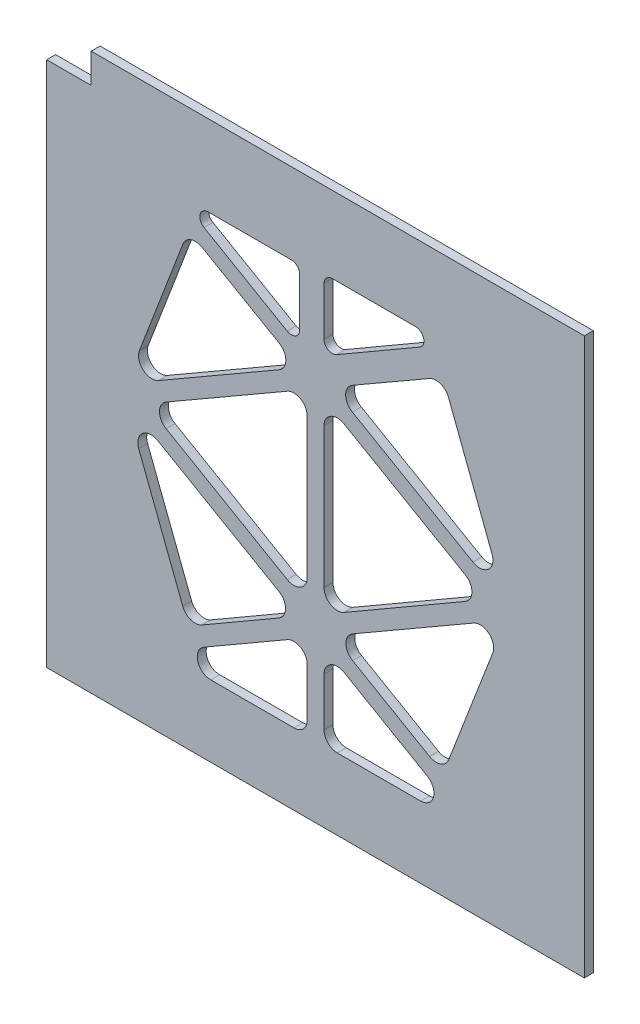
ISO-10303-21;
HEADER;
FILE_DESCRIPTION(('STEP AP214'),'2;1');
FILE_NAME('part.step','',(''),(''),'','','');
FILE_SCHEMA(('AUTOMOTIVE_DESIGN { 1 0 10303 214 1 1 1 1 }'));
ENDSEC;
DATA;
#1=APPLICATION_CONTEXT('core data for automotive mechanical design processes');
#2=APPLICATION_PROTOCOL_DEFINITION('international standard','automotive_design',2000,#1);
#3=PRODUCT_CONTEXT('',#1,'mechanical');
#4=PRODUCT('Part','Part','',(#3));
#5=PRODUCT_RELATED_PRODUCT_CATEGORY('part','',(#4));
#6=PRODUCT_DEFINITION_FORMATION('','',#4);
#7=PRODUCT_DEFINITION_CONTEXT('part definition',#1,'design');
#8=PRODUCT_DEFINITION('design','',#6,#7);
#9=PRODUCT_DEFINITION_SHAPE('','',#8);
#10=(LENGTH_UNIT() NAMED_UNIT(*) SI_UNIT(.MILLI.,.METRE.));
#11=(NAMED_UNIT(*) PLANE_ANGLE_UNIT() SI_UNIT($,.RADIAN.));
#12=(NAMED_UNIT(*) SI_UNIT($,.STERADIAN.) SOLID_ANGLE_UNIT());
#13=UNCERTAINTY_MEASURE_WITH_UNIT(LENGTH_MEASURE(1.E-05),#10,'distance_accuracy_value','');
#14=(GEOMETRIC_REPRESENTATION_CONTEXT(3) GLOBAL_UNCERTAINTY_ASSIGNED_CONTEXT((#13)) GLOBAL_UNIT_ASSIGNED_CONTEXT((#10,
#11,#12)) REPRESENTATION_CONTEXT('',''));
#15=CARTESIAN_POINT('',(0.,0.,0.));
#16=DIRECTION('',(0.,0.,1.));
#17=DIRECTION('',(1.,0.,0.));
#18=AXIS2_PLACEMENT_3D('',#15,#16,#17);
#19=CARTESIAN_POINT('',(69.210819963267,119.586403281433,1.6));
#20=DIRECTION('',(0.500909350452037,0.865499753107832,0.));
#21=DIRECTION('',(-0.865499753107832,0.500909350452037,0.));
#22=AXIS2_PLACEMENT_3D('',#19,#20,#21);
#23=PLANE('',#22);
#24=DIRECTION('',(0.865499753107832,-0.500909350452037,0.));
#25=VECTOR('',#24,1.);
#26=CARTESIAN_POINT('',(69.210819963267,119.586403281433,0.));
#27=LINE('',#26,#25);
#28=CARTESIAN_POINT('',(56.7887517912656,126.775694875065,0.));
#29=VERTEX_POINT('',#28);
#30=CARTESIAN_POINT('',(78.5604175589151,114.175308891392,0.));
#31=VERTEX_POINT('',#30);
#32=EDGE_CURVE('E648',#29,#31,#27,.T.);
#33=ORIENTED_EDGE('',*,*,#32,.F.);
#34=DIRECTION('',(0.,0.,-1.));
#35=VECTOR('',#34,1.);
#36=CARTESIAN_POINT('',(56.7887517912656,126.775694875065,1.6));
#37=LINE('',#36,#35);
#38=CARTESIAN_POINT('',(56.7887517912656,126.775694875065,1.6));
#39=VERTEX_POINT('',#38);
#40=EDGE_CURVE('E11',#39,#29,#37,.T.);
#41=ORIENTED_EDGE('',*,*,#40,.F.);
#42=DIRECTION('',(0.865499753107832,-0.500909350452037,0.));
#43=VECTOR('',#42,1.);
#44=CARTESIAN_POINT('',(69.210819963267,119.586403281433,1.6));
#45=LINE('',#44,#43);
#46=CARTESIAN_POINT('',(78.5604175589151,114.175308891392,1.6));
#47=VERTEX_POINT('',#46);
#48=EDGE_CURVE('E988',#39,#47,#45,.T.);
#49=ORIENTED_EDGE('',*,*,#48,.T.);
#50=DIRECTION('',(0.,0.,-1.));
#51=VECTOR('',#50,1.);
#52=CARTESIAN_POINT('',(78.5604175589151,114.175308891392,1.6));
#53=LINE('',#52,#51);
#54=EDGE_CURVE('E54',#47,#31,#53,.T.);
#55=ORIENTED_EDGE('',*,*,#54,.T.);
#56=EDGE_LOOP('',(#33,#41,#49,#55));
#57=FACE_BOUND('',#56,.T.);
#58=ADVANCED_FACE('F35',(#57),#23,.T.);
#59=CARTESIAN_POINT('',(57.9909342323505,128.852894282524,1.6));
#60=DIRECTION('',(0.,0.,-1.));
#61=DIRECTION('',(-1.,0.,0.));
#62=AXIS2_PLACEMENT_3D('',#59,#60,#61);
#63=CYLINDRICAL_SURFACE('',#62,2.4);
#64=CARTESIAN_POINT('',(57.9909342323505,128.852894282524,0.));
#65=DIRECTION('',(0.,0.,1.));
#66=DIRECTION('',(1.,0.,0.));
#67=AXIS2_PLACEMENT_3D('',#64,#65,#66);
#68=CIRCLE('',#67,2.4);
#69=CARTESIAN_POINT('',(56.7908373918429,130.931299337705,0.));
#70=VERTEX_POINT('',#69);
#71=EDGE_CURVE('E650',#29,#70,#68,.F.);
#72=ORIENTED_EDGE('',*,*,#71,.T.);
#73=DIRECTION('',(0.,0.,-1.));
#74=VECTOR('',#73,1.);
#75=CARTESIAN_POINT('',(56.7908373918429,130.931299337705,1.6));
#76=LINE('',#75,#74);
#77=CARTESIAN_POINT('',(56.7908373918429,130.931299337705,1.6));
#78=VERTEX_POINT('',#77);
#79=EDGE_CURVE('E45',#78,#70,#76,.T.);
#80=ORIENTED_EDGE('',*,*,#79,.F.);
#81=CARTESIAN_POINT('',(57.9909342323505,128.852894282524,1.6));
#82=DIRECTION('',(0.,0.,1.));
#83=DIRECTION('',(1.,0.,0.));
#84=AXIS2_PLACEMENT_3D('',#81,#82,#83);
#85=CIRCLE('',#84,2.4);
#86=EDGE_CURVE('E990',#39,#78,#85,.F.);
#87=ORIENTED_EDGE('',*,*,#86,.F.);
#88=ORIENTED_EDGE('',*,*,#40,.T.);
#89=EDGE_LOOP('',(#72,#80,#87,#88));
#90=FACE_BOUND('',#89,.T.);
#91=ADVANCED_FACE('F1010',(#90),#63,.F.);
#92=CARTESIAN_POINT('',(-42.4979647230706,73.6007143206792,1.6));
#93=DIRECTION('',(0.500040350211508,-0.866002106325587,0.));
#94=DIRECTION('',(0.866002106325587,0.500040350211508,0.));
#95=AXIS2_PLACEMENT_3D('',#92,#93,#94);
#96=PLANE('',#95);
#97=DIRECTION('',(-0.866002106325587,-0.500040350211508,0.));
#98=VECTOR('',#97,1.);
#99=CARTESIAN_POINT('',(-42.4979647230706,73.6007143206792,0.));
#100=LINE('',#99,#98);
#101=CARTESIAN_POINT('',(78.5625031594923,143.502529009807,0.));
#102=VERTEX_POINT('',#101);
#103=EDGE_CURVE('E653',#102,#70,#100,.T.);
#104=ORIENTED_EDGE('',*,*,#103,.F.);
#105=DIRECTION('',(0.,0.,-1.));
#106=VECTOR('',#105,1.);
#107=CARTESIAN_POINT('',(78.5625031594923,143.502529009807,1.6));
#108=LINE('',#107,#106);
#109=CARTESIAN_POINT('',(78.5625031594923,143.502529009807,1.6));
#110=VERTEX_POINT('',#109);
#111=EDGE_CURVE('E464',#110,#102,#108,.T.);
#112=ORIENTED_EDGE('',*,*,#111,.F.);
#113=DIRECTION('',(-0.866002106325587,-0.500040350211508,0.));
#114=VECTOR('',#113,1.);
#115=CARTESIAN_POINT('',(-42.4979647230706,73.6007143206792,1.6));
#116=LINE('',#115,#114);
#117=EDGE_CURVE('E474',#110,#78,#116,.T.);
#118=ORIENTED_EDGE('',*,*,#117,.T.);
#119=ORIENTED_EDGE('',*,*,#79,.T.);
#120=EDGE_LOOP('',(#104,#112,#118,#119));
#121=FACE_BOUND('',#120,.T.);
#122=ADVANCED_FACE('F993',(#121),#96,.T.);
#123=CARTESIAN_POINT('',(79.7626,141.424123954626,1.6));
#124=DIRECTION('',(0.,0.,-1.));
#125=DIRECTION('',(-1.,0.,0.));
#126=AXIS2_PLACEMENT_3D('',#123,#124,#125);
#127=CYLINDRICAL_SURFACE('',#126,2.40000000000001);
#128=CARTESIAN_POINT('',(79.7626,141.424123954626,0.));
#129=DIRECTION('',(0.,0.,1.));
#130=DIRECTION('',(1.,0.,0.));
#131=AXIS2_PLACEMENT_3D('',#128,#129,#130);
#132=CIRCLE('',#131,2.40000000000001);
#133=CARTESIAN_POINT('',(82.1626,141.424123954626,0.));
#134=VERTEX_POINT('',#133);
#135=EDGE_CURVE('E460',#134,#102,#132,.T.);
#136=ORIENTED_EDGE('',*,*,#135,.F.);
#137=DIRECTION('',(0.,0.,-1.));
#138=VECTOR('',#137,1.);
#139=CARTESIAN_POINT('',(82.1626,141.424123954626,1.6));
#140=LINE('',#139,#138);
#141=CARTESIAN_POINT('',(82.1626,141.424123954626,1.6));
#142=VERTEX_POINT('',#141);
#143=EDGE_CURVE('E455',#142,#134,#140,.T.);
#144=ORIENTED_EDGE('',*,*,#143,.F.);
#145=CARTESIAN_POINT('',(79.7626,141.424123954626,1.6));
#146=DIRECTION('',(0.,0.,1.));
#147=DIRECTION('',(1.,0.,0.));
#148=AXIS2_PLACEMENT_3D('',#145,#146,#147);
#149=CIRCLE('',#148,2.40000000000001);
#150=EDGE_CURVE('E458',#142,#110,#149,.T.);
#151=ORIENTED_EDGE('',*,*,#150,.T.);
#152=ORIENTED_EDGE('',*,*,#111,.T.);
#153=EDGE_LOOP('',(#136,#144,#151,#152));
#154=FACE_BOUND('',#153,.T.);
#155=ADVANCED_FACE('F457',(#154),#127,.F.);
#156=CARTESIAN_POINT('',(82.1626,0.,1.6));
#157=DIRECTION('',(-1.,0.,0.));
#158=DIRECTION('',(0.,0.,1.));
#159=AXIS2_PLACEMENT_3D('',#156,#157,#158);
#160=PLANE('',#159);
#161=DIRECTION('',(0.,1.,0.));
#162=VECTOR('',#161,1.);
#163=CARTESIAN_POINT('',(82.1626,0.,0.));
#164=LINE('',#163,#162);
#165=CARTESIAN_POINT('',(82.1626,116.252508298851,0.));
#166=VERTEX_POINT('',#165);
#167=EDGE_CURVE('E657',#166,#134,#164,.T.);
#168=ORIENTED_EDGE('',*,*,#167,.F.);
#169=DIRECTION('',(0.,0.,-1.));
#170=VECTOR('',#169,1.);
#171=CARTESIAN_POINT('',(82.1626,116.252508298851,1.6));
#172=LINE('',#171,#170);
#173=CARTESIAN_POINT('',(82.1626,116.252508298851,1.6));
#174=VERTEX_POINT('',#173);
#175=EDGE_CURVE('E253',#174,#166,#172,.T.);
#176=ORIENTED_EDGE('',*,*,#175,.F.);
#177=DIRECTION('',(0.,1.,0.));
#178=VECTOR('',#177,1.);
#179=CARTESIAN_POINT('',(82.1626,0.,1.6));
#180=LINE('',#179,#178);
#181=EDGE_CURVE('E472',#174,#142,#180,.T.);
#182=ORIENTED_EDGE('',*,*,#181,.T.);
#183=ORIENTED_EDGE('',*,*,#143,.T.);
#184=EDGE_LOOP('',(#168,#176,#182,#183));
#185=FACE_BOUND('',#184,.T.);
#186=ADVANCED_FACE('F476',(#185),#160,.T.);
#187=CARTESIAN_POINT('',(0.,91.6696,1.6));
#188=DIRECTION('',(0.,1.,0.));
#189=DIRECTION('',(0.,0.,1.));
#190=AXIS2_PLACEMENT_3D('',#187,#188,#189);
#191=PLANE('',#190);
#192=DIRECTION('',(1.,0.,0.));
#193=VECTOR('',#192,1.);
#194=CARTESIAN_POINT('',(0.,91.6696,0.));
#195=LINE('',#194,#193);
#196=CARTESIAN_POINT('',(87.5818,91.6696,0.));
#197=VERTEX_POINT('',#196);
#198=CARTESIAN_POINT('',(102.558052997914,91.6696,0.));
#199=VERTEX_POINT('',#198);
#200=EDGE_CURVE('E630',#197,#199,#195,.T.);
#201=ORIENTED_EDGE('',*,*,#200,.F.);
#202=DIRECTION('',(0.,0.,-1.));
#203=VECTOR('',#202,1.);
#204=CARTESIAN_POINT('',(87.5818,91.6696,1.6));
#205=LINE('',#204,#203);
#206=CARTESIAN_POINT('',(87.5818,91.6696,1.6));
#207=VERTEX_POINT('',#206);
#208=EDGE_CURVE('E664',#207,#197,#205,.T.);
#209=ORIENTED_EDGE('',*,*,#208,.F.);
#210=DIRECTION('',(1.,0.,0.));
#211=VECTOR('',#210,1.);
#212=CARTESIAN_POINT('',(0.,91.6696,1.6));
#213=LINE('',#212,#211);
#214=CARTESIAN_POINT('',(102.558052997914,91.6696,1.6));
#215=VERTEX_POINT('',#214);
#216=EDGE_CURVE('E971',#207,#215,#213,.T.);
#217=ORIENTED_EDGE('',*,*,#216,.T.);
#218=DIRECTION('',(0.,0.,-1.));
#219=VECTOR('',#218,1.);
#220=CARTESIAN_POINT('',(102.558052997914,91.6696,1.6));
#221=LINE('',#220,#219);
#222=EDGE_CURVE('E668',#215,#199,#221,.T.);
#223=ORIENTED_EDGE('',*,*,#222,.T.);
#224=EDGE_LOOP('',(#201,#209,#217,#223));
#225=FACE_BOUND('',#224,.T.);
#226=ADVANCED_FACE('F1040',(#225),#191,.T.);
#227=CARTESIAN_POINT('',(87.5818,94.0696,1.6));
#228=DIRECTION('',(0.,0.,-1.));
#229=DIRECTION('',(-1.,0.,0.));
#230=AXIS2_PLACEMENT_3D('',#227,#228,#229);
#231=CYLINDRICAL_SURFACE('',#230,2.39999999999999);
#232=CARTESIAN_POINT('',(87.5818,94.0696,0.));
#233=DIRECTION('',(0.,0.,1.));
#234=DIRECTION('',(1.,0.,0.));
#235=AXIS2_PLACEMENT_3D('',#232,#233,#234);
#236=CIRCLE('',#235,2.39999999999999);
#237=CARTESIAN_POINT('',(85.1818,94.0696,0.));
#238=VERTEX_POINT('',#237);
#239=EDGE_CURVE('E633',#197,#238,#236,.F.);
#240=ORIENTED_EDGE('',*,*,#239,.T.);
#241=DIRECTION('',(0.,0.,-1.));
#242=VECTOR('',#241,1.);
#243=CARTESIAN_POINT('',(85.1818,94.0696,1.6));
#244=LINE('',#243,#242);
#245=CARTESIAN_POINT('',(85.1818,94.0696,1.6));
#246=VERTEX_POINT('',#245);
#247=EDGE_CURVE('E677',#246,#238,#244,.T.);
#248=ORIENTED_EDGE('',*,*,#247,.F.);
#249=CARTESIAN_POINT('',(87.5818,94.0696,1.6));
#250=DIRECTION('',(0.,0.,1.));
#251=DIRECTION('',(1.,0.,0.));
#252=AXIS2_PLACEMENT_3D('',#249,#250,#251);
#253=CIRCLE('',#252,2.39999999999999);
#254=EDGE_CURVE('E974',#207,#246,#253,.F.);
#255=ORIENTED_EDGE('',*,*,#254,.F.);
#256=ORIENTED_EDGE('',*,*,#208,.T.);
#257=EDGE_LOOP('',(#240,#248,#255,#256));
#258=FACE_BOUND('',#257,.T.);
#259=ADVANCED_FACE('F1036',(#258),#231,.F.);
#260=CARTESIAN_POINT('',(85.1818,0.,1.6));
#261=DIRECTION('',(1.,0.,0.));
#262=DIRECTION('',(0.,0.,-1.));
#263=AXIS2_PLACEMENT_3D('',#260,#261,#262);
#264=PLANE('',#263);
#265=DIRECTION('',(0.,-1.,0.));
#266=VECTOR('',#265,1.);
#267=CARTESIAN_POINT('',(85.1818,0.,0.));
#268=LINE('',#267,#266);
#269=CARTESIAN_POINT('',(85.1818,102.747336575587,0.));
#270=VERTEX_POINT('',#269);
#271=EDGE_CURVE('E636',#270,#238,#268,.T.);
#272=ORIENTED_EDGE('',*,*,#271,.F.);
#273=DIRECTION('',(0.,0.,-1.));
#274=VECTOR('',#273,1.);
#275=CARTESIAN_POINT('',(85.1818,102.747336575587,1.6));
#276=LINE('',#275,#274);
#277=CARTESIAN_POINT('',(85.1818,102.747336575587,1.6));
#278=VERTEX_POINT('',#277);
#279=EDGE_CURVE('E675',#278,#270,#276,.T.);
#280=ORIENTED_EDGE('',*,*,#279,.F.);
#281=DIRECTION('',(0.,-1.,0.));
#282=VECTOR('',#281,1.);
#283=CARTESIAN_POINT('',(85.1818,0.,1.6));
#284=LINE('',#283,#282);
#285=EDGE_CURVE('E976',#278,#246,#284,.T.);
#286=ORIENTED_EDGE('',*,*,#285,.T.);
#287=ORIENTED_EDGE('',*,*,#247,.T.);
#288=EDGE_LOOP('',(#272,#280,#286,#287));
#289=FACE_BOUND('',#288,.T.);
#290=ADVANCED_FACE('F1032',(#289),#264,.T.);
#291=CARTESIAN_POINT('',(87.5818,102.747336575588,1.6));
#292=DIRECTION('',(0.,0.,-1.));
#293=DIRECTION('',(-1.,0.,0.));
#294=AXIS2_PLACEMENT_3D('',#291,#292,#293);
#295=CYLINDRICAL_SURFACE('',#294,2.4);
#296=CARTESIAN_POINT('',(87.5818,102.747336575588,0.));
#297=DIRECTION('',(0.,0.,1.));
#298=DIRECTION('',(1.,0.,0.));
#299=AXIS2_PLACEMENT_3D('',#296,#297,#298);
#300=CIRCLE('',#299,2.4);
#301=CARTESIAN_POINT('',(88.7850424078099,104.823922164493,0.));
#302=VERTEX_POINT('',#301);
#303=EDGE_CURVE('E639',#302,#270,#300,.T.);
#304=ORIENTED_EDGE('',*,*,#303,.F.);
#305=DIRECTION('',(0.,0.,-1.));
#306=VECTOR('',#305,1.);
#307=CARTESIAN_POINT('',(88.7850424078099,104.823922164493,1.6));
#308=LINE('',#307,#306);
#309=CARTESIAN_POINT('',(88.7850424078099,104.823922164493,1.6));
#310=VERTEX_POINT('',#309);
#311=EDGE_CURVE('E673',#310,#302,#308,.T.);
#312=ORIENTED_EDGE('',*,*,#311,.F.);
#313=CARTESIAN_POINT('',(87.5818,102.747336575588,1.6));
#314=DIRECTION('',(0.,0.,1.));
#315=DIRECTION('',(1.,0.,0.));
#316=AXIS2_PLACEMENT_3D('',#313,#314,#315);
#317=CIRCLE('',#316,2.4);
#318=EDGE_CURVE('E979',#310,#278,#317,.T.);
#319=ORIENTED_EDGE('',*,*,#318,.T.);
#320=ORIENTED_EDGE('',*,*,#279,.T.);
#321=EDGE_LOOP('',(#304,#312,#319,#320));
#322=FACE_BOUND('',#321,.T.);
#323=ADVANCED_FACE('F1028',(#322),#295,.F.);
#324=CARTESIAN_POINT('',(67.7880398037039,116.990280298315,1.6));
#325=DIRECTION('',(-0.501351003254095,-0.865243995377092,0.));
#326=DIRECTION('',(0.865243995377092,-0.501351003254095,0.));
#327=AXIS2_PLACEMENT_3D('',#324,#325,#326);
#328=PLANE('',#327);
#329=DIRECTION('',(-0.865243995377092,0.501351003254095,0.));
#330=VECTOR('',#329,1.);
#331=CARTESIAN_POINT('',(67.7880398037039,116.990280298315,0.));
#332=LINE('',#331,#330);
#333=CARTESIAN_POINT('',(103.761295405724,96.1461855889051,0.));
#334=VERTEX_POINT('',#333);
#335=EDGE_CURVE('E642',#334,#302,#332,.T.);
#336=ORIENTED_EDGE('',*,*,#335,.F.);
#337=DIRECTION('',(0.,0.,-1.));
#338=VECTOR('',#337,1.);
#339=CARTESIAN_POINT('',(103.761295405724,96.1461855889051,1.6));
#340=LINE('',#339,#338);
#341=CARTESIAN_POINT('',(103.761295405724,96.1461855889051,1.6));
#342=VERTEX_POINT('',#341);
#343=EDGE_CURVE('E670',#342,#334,#340,.T.);
#344=ORIENTED_EDGE('',*,*,#343,.F.);
#345=DIRECTION('',(-0.865243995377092,0.501351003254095,0.));
#346=VECTOR('',#345,1.);
#347=CARTESIAN_POINT('',(67.7880398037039,116.990280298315,1.6));
#348=LINE('',#347,#346);
#349=EDGE_CURVE('E982',#342,#310,#348,.T.);
#350=ORIENTED_EDGE('',*,*,#349,.T.);
#351=ORIENTED_EDGE('',*,*,#311,.T.);
#352=EDGE_LOOP('',(#336,#344,#350,#351));
#353=FACE_BOUND('',#352,.T.);
#354=ADVANCED_FACE('F1024',(#353),#328,.T.);
#355=CARTESIAN_POINT('',(91.5166441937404,109.505677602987,1.6));
#356=DIRECTION('',(0.,0.,-1.));
#357=DIRECTION('',(-1.,0.,0.));
#358=AXIS2_PLACEMENT_3D('',#355,#356,#357);
#359=CYLINDRICAL_SURFACE('',#358,2.4);
#360=CARTESIAN_POINT('',(91.5166441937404,109.505677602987,0.));
#361=DIRECTION('',(0.,0.,1.));
#362=DIRECTION('',(1.,0.,0.));
#363=AXIS2_PLACEMENT_3D('',#360,#361,#362);
#364=CIRCLE('',#363,2.4);
#365=CARTESIAN_POINT('',(90.3165473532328,111.584082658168,0.));
#366=VERTEX_POINT('',#365);
#367=CARTESIAN_POINT('',(90.3144617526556,107.428478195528,0.));
#368=VERTEX_POINT('',#367);
#369=EDGE_CURVE('E612',#366,#368,#364,.T.);
#370=ORIENTED_EDGE('',*,*,#369,.F.);
#371=DIRECTION('',(0.,0.,-1.));
#372=VECTOR('',#371,1.);
#373=CARTESIAN_POINT('',(90.3165473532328,111.584082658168,1.6));
#374=LINE('',#373,#372);
#375=CARTESIAN_POINT('',(90.3165473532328,111.584082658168,1.6));
#376=VERTEX_POINT('',#375);
#377=EDGE_CURVE('E671',#376,#366,#374,.T.);
#378=ORIENTED_EDGE('',*,*,#377,.F.);
#379=CARTESIAN_POINT('',(91.5166441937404,109.505677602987,1.6));
#380=DIRECTION('',(0.,0.,1.));
#381=DIRECTION('',(1.,0.,0.));
#382=AXIS2_PLACEMENT_3D('',#379,#380,#381);
#383=CIRCLE('',#382,2.4);
#384=CARTESIAN_POINT('',(90.3144617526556,107.428478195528,1.6));
#385=VERTEX_POINT('',#384);
#386=EDGE_CURVE('E953',#376,#385,#383,.T.);
#387=ORIENTED_EDGE('',*,*,#386,.T.);
#388=DIRECTION('',(0.,0.,-1.));
#389=VECTOR('',#388,1.);
#390=CARTESIAN_POINT('',(90.3144617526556,107.428478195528,1.6));
#391=LINE('',#390,#389);
#392=EDGE_CURVE('E680',#385,#368,#391,.T.);
#393=ORIENTED_EDGE('',*,*,#392,.T.);
#394=EDGE_LOOP('',(#370,#378,#387,#393));
#395=FACE_BOUND('',#394,.T.);
#396=ADVANCED_FACE('F1027',(#395),#359,.F.);
#397=CARTESIAN_POINT('',(-25.7371431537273,44.5732432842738,1.6));
#398=DIRECTION('',(0.500040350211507,-0.866002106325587,0.));
#399=DIRECTION('',(0.866002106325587,0.500040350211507,0.));
#400=AXIS2_PLACEMENT_3D('',#397,#398,#399);
#401=PLANE('',#400);
#402=DIRECTION('',(-0.866002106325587,-0.500040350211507,0.));
#403=VECTOR('',#402,1.);
#404=CARTESIAN_POINT('',(-25.7371431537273,44.5732432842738,0.));
#405=LINE('',#404,#403);
#406=CARTESIAN_POINT('',(112.090503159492,124.156634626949,0.));
#407=VERTEX_POINT('',#406);
#408=EDGE_CURVE('E615',#407,#366,#405,.T.);
#409=ORIENTED_EDGE('',*,*,#408,.F.);
#410=DIRECTION('',(0.,0.,-1.));
#411=VECTOR('',#410,1.);
#412=CARTESIAN_POINT('',(112.090503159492,124.156634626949,1.6));
#413=LINE('',#412,#411);
#414=CARTESIAN_POINT('',(112.090503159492,124.156634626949,1.6));
#415=VERTEX_POINT('',#414);
#416=EDGE_CURVE('E689',#415,#407,#413,.T.);
#417=ORIENTED_EDGE('',*,*,#416,.F.);
#418=DIRECTION('',(-0.866002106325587,-0.500040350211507,0.));
#419=VECTOR('',#418,1.);
#420=CARTESIAN_POINT('',(-25.7371431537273,44.5732432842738,1.6));
#421=LINE('',#420,#419);
#422=EDGE_CURVE('E956',#415,#376,#421,.T.);
#423=ORIENTED_EDGE('',*,*,#422,.T.);
#424=ORIENTED_EDGE('',*,*,#377,.T.);
#425=EDGE_LOOP('',(#409,#417,#423,#424));
#426=FACE_BOUND('',#425,.T.);
#427=ADVANCED_FACE('F1061',(#426),#401,.T.);
#428=CARTESIAN_POINT('',(113.2906,122.078229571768,1.6));
#429=DIRECTION('',(0.,0.,-1.));
#430=DIRECTION('',(-1.,0.,0.));
#431=AXIS2_PLACEMENT_3D('',#428,#429,#430);
#432=CYLINDRICAL_SURFACE('',#431,2.39999999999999);
#433=CARTESIAN_POINT('',(113.2906,122.078229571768,0.));
#434=DIRECTION('',(0.,0.,1.));
#435=DIRECTION('',(1.,0.,0.));
#436=AXIS2_PLACEMENT_3D('',#433,#434,#435);
#437=CIRCLE('',#436,2.39999999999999);
#438=CARTESIAN_POINT('',(115.530343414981,121.215936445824,0.));
#439=VERTEX_POINT('',#438);
#440=EDGE_CURVE('E618',#439,#407,#437,.T.);
#441=ORIENTED_EDGE('',*,*,#440,.F.);
#442=DIRECTION('',(0.,0.,-1.));
#443=VECTOR('',#442,1.);
#444=CARTESIAN_POINT('',(115.530343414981,121.215936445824,1.6));
#445=LINE('',#444,#443);
#446=CARTESIAN_POINT('',(115.530343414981,121.215936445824,1.6));
#447=VERTEX_POINT('',#446);
#448=EDGE_CURVE('E687',#447,#439,#445,.T.);
#449=ORIENTED_EDGE('',*,*,#448,.F.);
#450=CARTESIAN_POINT('',(113.2906,122.078229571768,1.6));
#451=DIRECTION('',(0.,0.,1.));
#452=DIRECTION('',(1.,0.,0.));
#453=AXIS2_PLACEMENT_3D('',#450,#451,#452);
#454=CIRCLE('',#453,2.39999999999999);
#455=EDGE_CURVE('E959',#447,#415,#454,.T.);
#456=ORIENTED_EDGE('',*,*,#455,.T.);
#457=ORIENTED_EDGE('',*,*,#416,.T.);
#458=EDGE_LOOP('',(#441,#449,#456,#457));
#459=FACE_BOUND('',#458,.T.);
#460=ADVANCED_FACE('F1057',(#459),#432,.F.);
#461=CARTESIAN_POINT('',(59.9732739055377,-23.0894938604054,1.6));
#462=DIRECTION('',(-0.933226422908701,0.359288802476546,0.));
#463=DIRECTION('',(-0.359288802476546,-0.933226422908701,0.));
#464=AXIS2_PLACEMENT_3D('',#461,#462,#463);
#465=PLANE('',#464);
#466=DIRECTION('',(0.359288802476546,0.933226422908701,0.));
#467=VECTOR('',#466,1.);
#468=CARTESIAN_POINT('',(59.9732739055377,-23.0894938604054,0.));
#469=LINE('',#468,#467);
#470=CARTESIAN_POINT('',(107.604383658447,100.628834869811,0.));
#471=VERTEX_POINT('',#470);
#472=EDGE_CURVE('E621',#471,#439,#469,.T.);
#473=ORIENTED_EDGE('',*,*,#472,.F.);
#474=DIRECTION('',(0.,0.,-1.));
#475=VECTOR('',#474,1.);
#476=CARTESIAN_POINT('',(107.604383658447,100.628834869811,1.6));
#477=LINE('',#476,#475);
#478=CARTESIAN_POINT('',(107.604383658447,100.628834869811,1.6));
#479=VERTEX_POINT('',#478);
#480=EDGE_CURVE('E685',#479,#471,#477,.T.);
#481=ORIENTED_EDGE('',*,*,#480,.F.);
#482=DIRECTION('',(0.359288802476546,0.933226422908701,0.));
#483=VECTOR('',#482,1.);
#484=CARTESIAN_POINT('',(59.9732739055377,-23.0894938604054,1.6));
#485=LINE('',#484,#483);
#486=EDGE_CURVE('E962',#479,#447,#485,.T.);
#487=ORIENTED_EDGE('',*,*,#486,.T.);
#488=ORIENTED_EDGE('',*,*,#448,.T.);
#489=EDGE_LOOP('',(#473,#481,#487,#488));
#490=FACE_BOUND('',#489,.T.);
#491=ADVANCED_FACE('F1053',(#490),#465,.T.);
#492=CARTESIAN_POINT('',(105.364640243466,101.491127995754,1.6));
#493=DIRECTION('',(0.,0.,-1.));
#494=DIRECTION('',(-1.,0.,0.));
#495=AXIS2_PLACEMENT_3D('',#492,#493,#494);
#496=CYLINDRICAL_SURFACE('',#495,2.39999999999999);
#497=CARTESIAN_POINT('',(105.364640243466,101.491127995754,0.));
#498=DIRECTION('',(0.,0.,1.));
#499=DIRECTION('',(1.,0.,0.));
#500=AXIS2_PLACEMENT_3D('',#497,#498,#499);
#501=CIRCLE('',#500,2.39999999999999);
#502=CARTESIAN_POINT('',(104.162457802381,99.4139285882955,0.));
#503=VERTEX_POINT('',#502);
#504=EDGE_CURVE('E624',#503,#471,#501,.T.);
#505=ORIENTED_EDGE('',*,*,#504,.F.);
#506=DIRECTION('',(0.,0.,-1.));
#507=VECTOR('',#506,1.);
#508=CARTESIAN_POINT('',(104.162457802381,99.4139285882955,1.6));
#509=LINE('',#508,#507);
#510=CARTESIAN_POINT('',(104.162457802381,99.4139285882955,1.6));
#511=VERTEX_POINT('',#510);
#512=EDGE_CURVE('E682',#511,#503,#509,.T.);
#513=ORIENTED_EDGE('',*,*,#512,.F.);
#514=CARTESIAN_POINT('',(105.364640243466,101.491127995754,1.6));
#515=DIRECTION('',(0.,0.,1.));
#516=DIRECTION('',(1.,0.,0.));
#517=AXIS2_PLACEMENT_3D('',#514,#515,#516);
#518=CIRCLE('',#517,2.39999999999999);
#519=EDGE_CURVE('E965',#511,#479,#518,.T.);
#520=ORIENTED_EDGE('',*,*,#519,.T.);
#521=ORIENTED_EDGE('',*,*,#480,.T.);
#522=EDGE_LOOP('',(#505,#513,#520,#521));
#523=FACE_BOUND('',#522,.T.);
#524=ADVANCED_FACE('F1049',(#523),#496,.F.);
#525=CARTESIAN_POINT('',(87.5818,116.236766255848,1.6));
#526=DIRECTION('',(0.,0.,-1.));
#527=DIRECTION('',(-1.,0.,0.));
#528=AXIS2_PLACEMENT_3D('',#525,#526,#527);
#529=CYLINDRICAL_SURFACE('',#528,2.4);
#530=CARTESIAN_POINT('',(87.5818,116.236766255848,0.));
#531=DIRECTION('',(0.,0.,1.));
#532=DIRECTION('',(1.,0.,0.));
#533=AXIS2_PLACEMENT_3D('',#530,#531,#532);
#534=CIRCLE('',#533,2.4);
#535=CARTESIAN_POINT('',(85.1818,116.236766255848,0.));
#536=VERTEX_POINT('',#535);
#537=CARTESIAN_POINT('',(88.7839824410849,114.159566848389,0.));
#538=VERTEX_POINT('',#537);
#539=EDGE_CURVE('E594',#536,#538,#534,.T.);
#540=ORIENTED_EDGE('',*,*,#539,.F.);
#541=DIRECTION('',(0.,0.,-1.));
#542=VECTOR('',#541,1.);
#543=CARTESIAN_POINT('',(85.1818,116.236766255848,1.6));
#544=LINE('',#543,#542);
#545=CARTESIAN_POINT('',(85.1818,116.236766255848,1.6));
#546=VERTEX_POINT('',#545);
#547=EDGE_CURVE('E683',#546,#536,#544,.T.);
#548=ORIENTED_EDGE('',*,*,#547,.F.);
#549=CARTESIAN_POINT('',(87.5818,116.236766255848,1.6));
#550=DIRECTION('',(0.,0.,1.));
#551=DIRECTION('',(1.,0.,0.));
#552=AXIS2_PLACEMENT_3D('',#549,#550,#551);
#553=CIRCLE('',#552,2.4);
#554=CARTESIAN_POINT('',(88.7839824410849,114.159566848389,1.6));
#555=VERTEX_POINT('',#554);
#556=EDGE_CURVE('E935',#546,#555,#553,.T.);
#557=ORIENTED_EDGE('',*,*,#556,.T.);
#558=DIRECTION('',(0.,0.,-1.));
#559=VECTOR('',#558,1.);
#560=CARTESIAN_POINT('',(88.7839824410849,114.159566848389,1.6));
#561=LINE('',#560,#559);
#562=EDGE_CURVE('E692',#555,#538,#561,.T.);
#563=ORIENTED_EDGE('',*,*,#562,.T.);
#564=EDGE_LOOP('',(#540,#548,#557,#563));
#565=FACE_BOUND('',#564,.T.);
#566=ADVANCED_FACE('F1052',(#565),#529,.F.);
#567=CARTESIAN_POINT('',(85.1818,0.,1.6));
#568=DIRECTION('',(1.,0.,0.));
#569=DIRECTION('',(0.,0.,-1.));
#570=AXIS2_PLACEMENT_3D('',#567,#568,#569);
#571=PLANE('',#570);
#572=DIRECTION('',(0.,-1.,0.));
#573=VECTOR('',#572,1.);
#574=CARTESIAN_POINT('',(85.1818,0.,0.));
#575=LINE('',#574,#573);
#576=CARTESIAN_POINT('',(85.1818,141.439829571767,0.));
#577=VERTEX_POINT('',#576);
#578=EDGE_CURVE('E597',#577,#536,#575,.T.);
#579=ORIENTED_EDGE('',*,*,#578,.F.);
#580=DIRECTION('',(0.,0.,-1.));
#581=VECTOR('',#580,1.);
#582=CARTESIAN_POINT('',(85.1818,141.439829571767,1.6));
#583=LINE('',#582,#581);
#584=CARTESIAN_POINT('',(85.1818,141.439829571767,1.6));
#585=VERTEX_POINT('',#584);
#586=EDGE_CURVE('E701',#585,#577,#583,.T.);
#587=ORIENTED_EDGE('',*,*,#586,.F.);
#588=DIRECTION('',(0.,-1.,0.));
#589=VECTOR('',#588,1.);
#590=CARTESIAN_POINT('',(85.1818,0.,1.6));
#591=LINE('',#590,#589);
#592=EDGE_CURVE('E938',#585,#546,#591,.T.);
#593=ORIENTED_EDGE('',*,*,#592,.T.);
#594=ORIENTED_EDGE('',*,*,#547,.T.);
#595=EDGE_LOOP('',(#579,#587,#593,#594));
#596=FACE_BOUND('',#595,.T.);
#597=ADVANCED_FACE('F1085',(#596),#571,.T.);
#598=CARTESIAN_POINT('',(87.5818,141.439829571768,1.6));
#599=DIRECTION('',(0.,0.,-1.));
#600=DIRECTION('',(-1.,0.,0.));
#601=AXIS2_PLACEMENT_3D('',#598,#599,#600);
#602=CYLINDRICAL_SURFACE('',#601,2.4);
#603=CARTESIAN_POINT('',(87.5818,141.439829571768,0.));
#604=DIRECTION('',(0.,0.,1.));
#605=DIRECTION('',(1.,0.,0.));
#606=AXIS2_PLACEMENT_3D('',#603,#604,#605);
#607=CIRCLE('',#606,2.4);
#608=CARTESIAN_POINT('',(88.7818968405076,143.518234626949,0.));
#609=VERTEX_POINT('',#608);
#610=EDGE_CURVE('E600',#609,#577,#607,.T.);
#611=ORIENTED_EDGE('',*,*,#610,.F.);
#612=DIRECTION('',(0.,0.,-1.));
#613=VECTOR('',#612,1.);
#614=CARTESIAN_POINT('',(88.7818968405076,143.518234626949,1.6));
#615=LINE('',#614,#613);
#616=CARTESIAN_POINT('',(88.7818968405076,143.518234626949,1.6));
#617=VERTEX_POINT('',#616);
#618=EDGE_CURVE('E699',#617,#609,#615,.T.);
#619=ORIENTED_EDGE('',*,*,#618,.F.);
#620=CARTESIAN_POINT('',(87.5818,141.439829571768,1.6));
#621=DIRECTION('',(0.,0.,1.));
#622=DIRECTION('',(1.,0.,0.));
#623=AXIS2_PLACEMENT_3D('',#620,#621,#622);
#624=CIRCLE('',#623,2.4);
#625=EDGE_CURVE('E941',#617,#585,#624,.T.);
#626=ORIENTED_EDGE('',*,*,#625,.T.);
#627=ORIENTED_EDGE('',*,*,#586,.T.);
#628=EDGE_LOOP('',(#611,#619,#626,#627));
#629=FACE_BOUND('',#628,.T.);
#630=ADVANCED_FACE('F1081',(#629),#602,.F.);
#631=CARTESIAN_POINT('',(84.3476184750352,146.078641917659,1.6));
#632=DIRECTION('',(-0.500040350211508,-0.866002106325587,0.));
#633=DIRECTION('',(0.866002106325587,-0.500040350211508,0.));
#634=AXIS2_PLACEMENT_3D('',#631,#632,#633);
#635=PLANE('',#634);
#636=DIRECTION('',(-0.866002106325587,0.500040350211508,0.));
#637=VECTOR('',#636,1.);
#638=CARTESIAN_POINT('',(84.3476184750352,146.078641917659,0.));
#639=LINE('',#638,#637);
#640=CARTESIAN_POINT('',(110.580762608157,130.931299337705,0.));
#641=VERTEX_POINT('',#640);
#642=EDGE_CURVE('E603',#641,#609,#639,.T.);
#643=ORIENTED_EDGE('',*,*,#642,.F.);
#644=DIRECTION('',(0.,0.,-1.));
#645=VECTOR('',#644,1.);
#646=CARTESIAN_POINT('',(110.580762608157,130.931299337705,1.6));
#647=LINE('',#646,#645);
#648=CARTESIAN_POINT('',(110.580762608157,130.931299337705,1.6));
#649=VERTEX_POINT('',#648);
#650=EDGE_CURVE('E697',#649,#641,#647,.T.);
#651=ORIENTED_EDGE('',*,*,#650,.F.);
#652=DIRECTION('',(-0.866002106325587,0.500040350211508,0.));
#653=VECTOR('',#652,1.);
#654=CARTESIAN_POINT('',(84.3476184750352,146.078641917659,1.6));
#655=LINE('',#654,#653);
#656=EDGE_CURVE('E944',#649,#617,#655,.T.);
#657=ORIENTED_EDGE('',*,*,#656,.T.);
#658=ORIENTED_EDGE('',*,*,#618,.T.);
#659=EDGE_LOOP('',(#643,#651,#657,#658));
#660=FACE_BOUND('',#659,.T.);
#661=ADVANCED_FACE('F1077',(#660),#635,.T.);
#662=CARTESIAN_POINT('',(109.38066576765,128.852894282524,1.6));
#663=DIRECTION('',(0.,0.,-1.));
#664=DIRECTION('',(-1.,0.,0.));
#665=AXIS2_PLACEMENT_3D('',#662,#663,#664);
#666=CYLINDRICAL_SURFACE('',#665,2.4);
#667=CARTESIAN_POINT('',(109.38066576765,128.852894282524,0.));
#668=DIRECTION('',(0.,0.,1.));
#669=DIRECTION('',(1.,0.,0.));
#670=AXIS2_PLACEMENT_3D('',#667,#668,#669);
#671=CIRCLE('',#670,2.4);
#672=CARTESIAN_POINT('',(110.582848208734,126.775694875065,0.));
#673=VERTEX_POINT('',#672);
#674=EDGE_CURVE('E606',#673,#641,#671,.T.);
#675=ORIENTED_EDGE('',*,*,#674,.F.);
#676=DIRECTION('',(0.,0.,-1.));
#677=VECTOR('',#676,1.);
#678=CARTESIAN_POINT('',(110.582848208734,126.775694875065,1.6));
#679=LINE('',#678,#677);
#680=CARTESIAN_POINT('',(110.582848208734,126.775694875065,1.6));
#681=VERTEX_POINT('',#680);
#682=EDGE_CURVE('E694',#681,#673,#679,.T.);
#683=ORIENTED_EDGE('',*,*,#682,.F.);
#684=CARTESIAN_POINT('',(109.38066576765,128.852894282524,1.6));
#685=DIRECTION('',(0.,0.,1.));
#686=DIRECTION('',(1.,0.,0.));
#687=AXIS2_PLACEMENT_3D('',#684,#685,#686);
#688=CIRCLE('',#687,2.4);
#689=EDGE_CURVE('E947',#681,#649,#688,.T.);
#690=ORIENTED_EDGE('',*,*,#689,.T.);
#691=ORIENTED_EDGE('',*,*,#650,.T.);
#692=EDGE_LOOP('',(#675,#683,#690,#691));
#693=FACE_BOUND('',#692,.T.);
#694=ADVANCED_FACE('F1073',(#693),#666,.F.);
#695=CARTESIAN_POINT('',(86.6818,154.929463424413,1.6));
#696=DIRECTION('',(0.,0.,-1.));
#697=DIRECTION('',(-1.,0.,0.));
#698=AXIS2_PLACEMENT_3D('',#695,#696,#697);
#699=CYLINDRICAL_SURFACE('',#698,1.49999999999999);
#700=CARTESIAN_POINT('',(86.6818,154.929463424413,0.));
#701=DIRECTION('',(0.,0.,1.));
#702=DIRECTION('',(1.,0.,0.));
#703=AXIS2_PLACEMENT_3D('',#700,#701,#702);
#704=CIRCLE('',#703,1.49999999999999);
#705=CARTESIAN_POINT('',(85.1818,154.929463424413,0.));
#706=VERTEX_POINT('',#705);
#707=CARTESIAN_POINT('',(87.4338265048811,153.631597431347,0.));
#708=VERTEX_POINT('',#707);
#709=EDGE_CURVE('E576',#706,#708,#704,.T.);
#710=ORIENTED_EDGE('',*,*,#709,.F.);
#711=DIRECTION('',(0.,0.,-1.));
#712=VECTOR('',#711,1.);
#713=CARTESIAN_POINT('',(85.1818,154.929463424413,1.6));
#714=LINE('',#713,#712);
#715=CARTESIAN_POINT('',(85.1818,154.929463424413,1.6));
#716=VERTEX_POINT('',#715);
#717=EDGE_CURVE('E695',#716,#706,#714,.T.);
#718=ORIENTED_EDGE('',*,*,#717,.F.);
#719=CARTESIAN_POINT('',(86.6818,154.929463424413,1.6));
#720=DIRECTION('',(0.,0.,1.));
#721=DIRECTION('',(1.,0.,0.));
#722=AXIS2_PLACEMENT_3D('',#719,#720,#721);
#723=CIRCLE('',#722,1.49999999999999);
#724=CARTESIAN_POINT('',(87.4338265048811,153.631597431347,1.6));
#725=VERTEX_POINT('',#724);
#726=EDGE_CURVE('E917',#716,#725,#723,.T.);
#727=ORIENTED_EDGE('',*,*,#726,.T.);
#728=DIRECTION('',(0.,0.,-1.));
#729=VECTOR('',#728,1.);
#730=CARTESIAN_POINT('',(87.4338265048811,153.631597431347,1.6));
#731=LINE('',#730,#729);
#732=EDGE_CURVE('E704',#725,#708,#731,.T.);
#733=ORIENTED_EDGE('',*,*,#732,.T.);
#734=EDGE_LOOP('',(#710,#718,#727,#733));
#735=FACE_BOUND('',#734,.T.);
#736=ADVANCED_FACE('F1076',(#735),#699,.F.);
#737=CARTESIAN_POINT('',(85.1818,0.,1.6));
#738=DIRECTION('',(1.,0.,0.));
#739=DIRECTION('',(0.,0.,-1.));
#740=AXIS2_PLACEMENT_3D('',#737,#738,#739);
#741=PLANE('',#740);
#742=DIRECTION('',(0.,-1.,0.));
#743=VECTOR('',#742,1.);
#744=CARTESIAN_POINT('',(85.1818,0.,0.));
#745=LINE('',#744,#743);
#746=CARTESIAN_POINT('',(85.1818,163.6072,0.));
#747=VERTEX_POINT('',#746);
#748=EDGE_CURVE('E579',#747,#706,#745,.T.);
#749=ORIENTED_EDGE('',*,*,#748,.F.);
#750=DIRECTION('',(0.,0.,-1.));
#751=VECTOR('',#750,1.);
#752=CARTESIAN_POINT('',(85.1818,163.6072,1.6));
#753=LINE('',#752,#751);
#754=CARTESIAN_POINT('',(85.1818,163.6072,1.6));
#755=VERTEX_POINT('',#754);
#756=EDGE_CURVE('E713',#755,#747,#753,.T.);
#757=ORIENTED_EDGE('',*,*,#756,.F.);
#758=DIRECTION('',(0.,-1.,0.));
#759=VECTOR('',#758,1.);
#760=CARTESIAN_POINT('',(85.1818,0.,1.6));
#761=LINE('',#760,#759);
#762=EDGE_CURVE('E920',#755,#716,#761,.T.);
#763=ORIENTED_EDGE('',*,*,#762,.T.);
#764=ORIENTED_EDGE('',*,*,#717,.T.);
#765=EDGE_LOOP('',(#749,#757,#763,#764));
#766=FACE_BOUND('',#765,.T.);
#767=ADVANCED_FACE('F1109',(#766),#741,.T.);
#768=CARTESIAN_POINT('',(86.6818,163.6072,1.6));
#769=DIRECTION('',(0.,0.,-1.));
#770=DIRECTION('',(-1.,0.,0.));
#771=AXIS2_PLACEMENT_3D('',#768,#769,#770);
#772=CYLINDRICAL_SURFACE('',#771,1.5);
#773=CARTESIAN_POINT('',(86.6818,163.6072,0.));
#774=DIRECTION('',(0.,0.,1.));
#775=DIRECTION('',(1.,0.,0.));
#776=AXIS2_PLACEMENT_3D('',#773,#774,#775);
#777=CIRCLE('',#776,1.5);
#778=CARTESIAN_POINT('',(86.6818,165.1072,0.));
#779=VERTEX_POINT('',#778);
#780=EDGE_CURVE('E582',#779,#747,#777,.T.);
#781=ORIENTED_EDGE('',*,*,#780,.F.);
#782=DIRECTION('',(0.,0.,-1.));
#783=VECTOR('',#782,1.);
#784=CARTESIAN_POINT('',(86.6818,165.1072,1.6));
#785=LINE('',#784,#783);
#786=CARTESIAN_POINT('',(86.6818,165.1072,1.6));
#787=VERTEX_POINT('',#786);
#788=EDGE_CURVE('E711',#787,#779,#785,.T.);
#789=ORIENTED_EDGE('',*,*,#788,.F.);
#790=CARTESIAN_POINT('',(86.6818,163.6072,1.6));
#791=DIRECTION('',(0.,0.,1.));
#792=DIRECTION('',(1.,0.,0.));
#793=AXIS2_PLACEMENT_3D('',#790,#791,#792);
#794=CIRCLE('',#793,1.5);
#795=EDGE_CURVE('E923',#787,#755,#794,.T.);
#796=ORIENTED_EDGE('',*,*,#795,.T.);
#797=ORIENTED_EDGE('',*,*,#756,.T.);
#798=EDGE_LOOP('',(#781,#789,#796,#797));
#799=FACE_BOUND('',#798,.T.);
#800=ADVANCED_FACE('F1105',(#799),#772,.F.);
#801=CARTESIAN_POINT('',(0.,165.1072,1.6));
#802=DIRECTION('',(0.,-1.,0.));
#803=DIRECTION('',(0.,0.,-1.));
#804=AXIS2_PLACEMENT_3D('',#801,#802,#803);
#805=PLANE('',#804);
#806=DIRECTION('',(-1.,0.,0.));
#807=VECTOR('',#806,1.);
#808=CARTESIAN_POINT('',(0.,165.1072,0.));
#809=LINE('',#808,#807);
#810=CARTESIAN_POINT('',(101.658052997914,165.1072,0.));
#811=VERTEX_POINT('',#810);
#812=EDGE_CURVE('E585',#811,#779,#809,.T.);
#813=ORIENTED_EDGE('',*,*,#812,.F.);
#814=DIRECTION('',(0.,0.,-1.));
#815=VECTOR('',#814,1.);
#816=CARTESIAN_POINT('',(101.658052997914,165.1072,1.6));
#817=LINE('',#816,#815);
#818=CARTESIAN_POINT('',(101.658052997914,165.1072,1.6));
#819=VERTEX_POINT('',#818);
#820=EDGE_CURVE('E709',#819,#811,#817,.T.);
#821=ORIENTED_EDGE('',*,*,#820,.F.);
#822=DIRECTION('',(-1.,0.,0.));
#823=VECTOR('',#822,1.);
#824=CARTESIAN_POINT('',(0.,165.1072,1.6));
#825=LINE('',#824,#823);
#826=EDGE_CURVE('E926',#819,#787,#825,.T.);
#827=ORIENTED_EDGE('',*,*,#826,.T.);
#828=ORIENTED_EDGE('',*,*,#788,.T.);
#829=EDGE_LOOP('',(#813,#821,#827,#828));
#830=FACE_BOUND('',#829,.T.);
#831=ADVANCED_FACE('F1101',(#830),#805,.T.);
#832=CARTESIAN_POINT('',(101.658052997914,163.6072,1.6));
#833=DIRECTION('',(0.,0.,-1.));
#834=DIRECTION('',(-1.,0.,0.));
#835=AXIS2_PLACEMENT_3D('',#832,#833,#834);
#836=CYLINDRICAL_SURFACE('',#835,1.5);
#837=CARTESIAN_POINT('',(101.658052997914,163.6072,0.));
#838=DIRECTION('',(0.,0.,1.));
#839=DIRECTION('',(1.,0.,0.));
#840=AXIS2_PLACEMENT_3D('',#837,#838,#839);
#841=CIRCLE('',#840,1.5);
#842=CARTESIAN_POINT('',(102.410079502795,162.309334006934,0.));
#843=VERTEX_POINT('',#842);
#844=EDGE_CURVE('E588',#843,#811,#841,.T.);
#845=ORIENTED_EDGE('',*,*,#844,.F.);
#846=DIRECTION('',(0.,0.,-1.));
#847=VECTOR('',#846,1.);
#848=CARTESIAN_POINT('',(102.410079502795,162.309334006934,1.6));
#849=LINE('',#848,#847);
#850=CARTESIAN_POINT('',(102.410079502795,162.309334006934,1.6));
#851=VERTEX_POINT('',#850);
#852=EDGE_CURVE('E706',#851,#843,#849,.T.);
#853=ORIENTED_EDGE('',*,*,#852,.F.);
#854=CARTESIAN_POINT('',(101.658052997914,163.6072,1.6));
#855=DIRECTION('',(0.,0.,1.));
#856=DIRECTION('',(1.,0.,0.));
#857=AXIS2_PLACEMENT_3D('',#854,#855,#856);
#858=CIRCLE('',#857,1.5);
#859=EDGE_CURVE('E929',#851,#819,#858,.T.);
#860=ORIENTED_EDGE('',*,*,#859,.T.);
#861=ORIENTED_EDGE('',*,*,#820,.T.);
#862=EDGE_LOOP('',(#845,#853,#860,#861));
#863=FACE_BOUND('',#862,.T.);
#864=ADVANCED_FACE('F1097',(#863),#836,.F.);
#865=CARTESIAN_POINT('',(-0.140315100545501,0.0535775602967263,1.6));
#866=DIRECTION('',(-0.934212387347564,0.356717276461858,0.));
#867=DIRECTION('',(-0.356717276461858,-0.934212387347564,0.));
#868=AXIS2_PLACEMENT_3D('',#865,#866,#867);
#869=PLANE('',#868);
#870=DIRECTION('',(0.356717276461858,0.934212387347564,0.));
#871=VECTOR('',#870,1.);
#872=CARTESIAN_POINT('',(-0.140315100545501,0.0535775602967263,0.));
#873=LINE('',#872,#871);
#874=CARTESIAN_POINT('',(51.9700505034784,136.526219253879,0.));
#875=VERTEX_POINT('',#874);
#876=CARTESIAN_POINT('',(59.8034952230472,157.041348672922,0.));
#877=VERTEX_POINT('',#876);
#878=EDGE_CURVE('E563',#875,#877,#873,.T.);
#879=ORIENTED_EDGE('',*,*,#878,.T.);
#880=DIRECTION('',(0.,0.,-1.));
#881=VECTOR('',#880,1.);
#882=CARTESIAN_POINT('',(59.8034952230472,157.041348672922,1.6));
#883=LINE('',#882,#881);
#884=CARTESIAN_POINT('',(59.8034952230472,157.041348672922,1.6));
#885=VERTEX_POINT('',#884);
#886=EDGE_CURVE('E707',#885,#877,#883,.T.);
#887=ORIENTED_EDGE('',*,*,#886,.F.);
#888=DIRECTION('',(0.356717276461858,0.934212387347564,0.));
#889=VECTOR('',#888,1.);
#890=CARTESIAN_POINT('',(-0.140315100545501,0.0535775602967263,1.6));
#891=LINE('',#890,#889);
#892=CARTESIAN_POINT('',(51.9700505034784,136.526219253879,1.6));
#893=VERTEX_POINT('',#892);
#894=EDGE_CURVE('E904',#893,#885,#891,.T.);
#895=ORIENTED_EDGE('',*,*,#894,.F.);
#896=DIRECTION('',(0.,0.,-1.));
#897=VECTOR('',#896,1.);
#898=CARTESIAN_POINT('',(51.9700505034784,136.526219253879,1.6));
#899=LINE('',#898,#897);
#900=EDGE_CURVE('E716',#893,#875,#899,.T.);
#901=ORIENTED_EDGE('',*,*,#900,.T.);
#902=EDGE_LOOP('',(#879,#887,#895,#901));
#903=FACE_BOUND('',#902,.T.);
#904=ADVANCED_FACE('F1100',(#903),#869,.F.);
#905=CARTESIAN_POINT('',(62.0456049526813,156.185227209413,1.6));
#906=DIRECTION('',(0.,0.,-1.));
#907=DIRECTION('',(-1.,0.,0.));
#908=AXIS2_PLACEMENT_3D('',#905,#906,#907);
#909=CYLINDRICAL_SURFACE('',#908,2.39999999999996);
#910=CARTESIAN_POINT('',(62.0456049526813,156.185227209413,0.));
#911=DIRECTION('',(0.,0.,1.));
#912=DIRECTION('',(1.,0.,0.));
#913=AXIS2_PLACEMENT_3D('',#910,#911,#912);
#914=CIRCLE('',#913,2.39999999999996);
#915=CARTESIAN_POINT('',(63.2436125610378,158.264837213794,0.));
#916=VERTEX_POINT('',#915);
#917=EDGE_CURVE('E566',#877,#916,#914,.F.);
#918=ORIENTED_EDGE('',*,*,#917,.T.);
#919=DIRECTION('',(0.,0.,-1.));
#920=VECTOR('',#919,1.);
#921=CARTESIAN_POINT('',(63.2436125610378,158.264837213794,1.6));
#922=LINE('',#921,#920);
#923=CARTESIAN_POINT('',(63.2436125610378,158.264837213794,1.6));
#924=VERTEX_POINT('',#923);
#925=EDGE_CURVE('E729',#924,#916,#922,.T.);
#926=ORIENTED_EDGE('',*,*,#925,.F.);
#927=CARTESIAN_POINT('',(62.0456049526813,156.185227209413,1.6));
#928=DIRECTION('',(0.,0.,1.));
#929=DIRECTION('',(1.,0.,0.));
#930=AXIS2_PLACEMENT_3D('',#927,#928,#929);
#931=CIRCLE('',#930,2.39999999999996);
#932=EDGE_CURVE('E907',#885,#924,#931,.F.);
#933=ORIENTED_EDGE('',*,*,#932,.F.);
#934=ORIENTED_EDGE('',*,*,#886,.T.);
#935=EDGE_LOOP('',(#918,#926,#933,#934));
#936=FACE_BOUND('',#935,.T.);
#937=ADVANCED_FACE('F1133',(#936),#909,.F.);
#938=CARTESIAN_POINT('',(84.2131685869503,146.184837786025,1.6));
#939=DIRECTION('',(0.499169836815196,0.866504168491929,0.));
#940=DIRECTION('',(-0.866504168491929,0.499169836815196,0.));
#941=AXIS2_PLACEMENT_3D('',#938,#939,#940);
#942=PLANE('',#941);
#943=DIRECTION('',(0.866504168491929,-0.499169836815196,0.));
#944=VECTOR('',#943,1.);
#945=CARTESIAN_POINT('',(84.2131685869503,146.184837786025,0.));
#946=LINE('',#945,#944);
#947=CARTESIAN_POINT('',(77.1076792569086,150.278119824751,0.));
#948=VERTEX_POINT('',#947);
#949=EDGE_CURVE('E568',#916,#948,#946,.T.);
#950=ORIENTED_EDGE('',*,*,#949,.T.);
#951=DIRECTION('',(0.,0.,-1.));
#952=VECTOR('',#951,1.);
#953=CARTESIAN_POINT('',(77.1076792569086,150.278119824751,1.6));
#954=LINE('',#953,#952);
#955=CARTESIAN_POINT('',(77.1076792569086,150.278119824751,1.6));
#956=VERTEX_POINT('',#955);
#957=EDGE_CURVE('E726',#956,#948,#954,.T.);
#958=ORIENTED_EDGE('',*,*,#957,.F.);
#959=DIRECTION('',(0.866504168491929,-0.499169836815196,0.));
#960=VECTOR('',#959,1.);
#961=CARTESIAN_POINT('',(84.2131685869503,146.184837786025,1.6));
#962=LINE('',#961,#960);
#963=EDGE_CURVE('E909',#924,#956,#962,.T.);
#964=ORIENTED_EDGE('',*,*,#963,.F.);
#965=ORIENTED_EDGE('',*,*,#925,.T.);
#966=EDGE_LOOP('',(#950,#958,#964,#965));
#967=FACE_BOUND('',#966,.T.);
#968=ADVANCED_FACE('F1129',(#967),#942,.F.);
#969=CARTESIAN_POINT('',(75.9096716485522,148.19850982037,1.6));
#970=DIRECTION('',(0.,0.,-1.));
#971=DIRECTION('',(-1.,0.,0.));
#972=AXIS2_PLACEMENT_3D('',#969,#970,#971);
#973=CYLINDRICAL_SURFACE('',#972,2.4);
#974=CARTESIAN_POINT('',(75.9096716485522,148.19850982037,0.));
#975=DIRECTION('',(0.,0.,1.));
#976=DIRECTION('',(1.,0.,0.));
#977=AXIS2_PLACEMENT_3D('',#974,#975,#976);
#978=CIRCLE('',#977,2.4);
#979=CARTESIAN_POINT('',(77.1097684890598,146.120104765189,0.));
#980=VERTEX_POINT('',#979);
#981=EDGE_CURVE('E570',#948,#980,#978,.F.);
#982=ORIENTED_EDGE('',*,*,#981,.T.);
#983=DIRECTION('',(0.,0.,-1.));
#984=VECTOR('',#983,1.);
#985=CARTESIAN_POINT('',(77.1097684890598,146.120104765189,1.6));
#986=LINE('',#985,#984);
#987=CARTESIAN_POINT('',(77.1097684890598,146.120104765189,1.6));
#988=VERTEX_POINT('',#987);
#989=EDGE_CURVE('E723',#988,#980,#986,.T.);
#990=ORIENTED_EDGE('',*,*,#989,.F.);
#991=CARTESIAN_POINT('',(75.9096716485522,148.19850982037,1.6));
#992=DIRECTION('',(0.,0.,1.));
#993=DIRECTION('',(1.,0.,0.));
#994=AXIS2_PLACEMENT_3D('',#991,#992,#993);
#995=CIRCLE('',#994,2.4);
#996=EDGE_CURVE('E911',#956,#988,#995,.F.);
#997=ORIENTED_EDGE('',*,*,#996,.F.);
#998=ORIENTED_EDGE('',*,*,#957,.T.);
#999=EDGE_LOOP('',(#982,#990,#997,#998));
#1000=FACE_BOUND('',#999,.T.);
#1001=ADVANCED_FACE('F1125',(#1000),#973,.F.);
#1002=CARTESIAN_POINT('',(-43.9947115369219,76.1928769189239,1.6));
#1003=DIRECTION('',(0.500040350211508,-0.866002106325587,0.));
#1004=DIRECTION('',(0.866002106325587,0.500040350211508,0.));
#1005=AXIS2_PLACEMENT_3D('',#1002,#1003,#1004);
#1006=PLANE('',#1005);
#1007=DIRECTION('',(-0.866002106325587,-0.500040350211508,0.));
#1008=VECTOR('',#1007,1.);
#1009=CARTESIAN_POINT('',(-43.9947115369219,76.1928769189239,0.));
#1010=LINE('',#1009,#1008);
#1011=CARTESIAN_POINT('',(55.4122570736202,133.591692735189,0.));
#1012=VERTEX_POINT('',#1011);
#1013=EDGE_CURVE('E572',#980,#1012,#1010,.T.);
#1014=ORIENTED_EDGE('',*,*,#1013,.T.);
#1015=DIRECTION('',(0.,0.,-1.));
#1016=VECTOR('',#1015,1.);
#1017=CARTESIAN_POINT('',(55.4122570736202,133.591692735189,1.6));
#1018=LINE('',#1017,#1016);
#1019=CARTESIAN_POINT('',(55.4122570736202,133.591692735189,1.6));
#1020=VERTEX_POINT('',#1019);
#1021=EDGE_CURVE('E719',#1020,#1012,#1018,.T.);
#1022=ORIENTED_EDGE('',*,*,#1021,.F.);
#1023=DIRECTION('',(-0.866002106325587,-0.500040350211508,0.));
#1024=VECTOR('',#1023,1.);
#1025=CARTESIAN_POINT('',(-43.9947115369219,76.1928769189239,1.6));
#1026=LINE('',#1025,#1024);
#1027=EDGE_CURVE('E913',#988,#1020,#1026,.T.);
#1028=ORIENTED_EDGE('',*,*,#1027,.F.);
#1029=ORIENTED_EDGE('',*,*,#989,.T.);
#1030=EDGE_LOOP('',(#1014,#1022,#1028,#1029));
#1031=FACE_BOUND('',#1030,.T.);
#1032=ADVANCED_FACE('F1121',(#1031),#1006,.F.);
#1033=CARTESIAN_POINT('',(113.163953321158,135.670097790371,1.6));
#1034=DIRECTION('',(0.,0.,-1.));
#1035=DIRECTION('',(-1.,0.,0.));
#1036=AXIS2_PLACEMENT_3D('',#1033,#1034,#1035);
#1037=CYLINDRICAL_SURFACE('',#1036,2.40000000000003);
#1038=CARTESIAN_POINT('',(113.163953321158,135.670097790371,0.));
#1039=DIRECTION('',(0.,0.,1.));
#1040=DIRECTION('',(1.,0.,0.));
#1041=AXIS2_PLACEMENT_3D('',#1038,#1039,#1040);
#1042=CIRCLE('',#1041,2.40000000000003);
#1043=CARTESIAN_POINT('',(111.96385648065,133.59169273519,0.));
#1044=VERTEX_POINT('',#1043);
#1045=CARTESIAN_POINT('',(115.406063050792,136.52621925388,0.));
#1046=VERTEX_POINT('',#1045);
#1047=EDGE_CURVE('E545',#1044,#1046,#1042,.T.);
#1048=ORIENTED_EDGE('',*,*,#1047,.F.);
#1049=DIRECTION('',(0.,0.,-1.));
#1050=VECTOR('',#1049,1.);
#1051=CARTESIAN_POINT('',(111.96385648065,133.59169273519,1.6));
#1052=LINE('',#1051,#1050);
#1053=CARTESIAN_POINT('',(111.96385648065,133.59169273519,1.6));
#1054=VERTEX_POINT('',#1053);
#1055=EDGE_CURVE('E720',#1054,#1044,#1052,.T.);
#1056=ORIENTED_EDGE('',*,*,#1055,.F.);
#1057=CARTESIAN_POINT('',(113.163953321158,135.670097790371,1.6));
#1058=DIRECTION('',(0.,0.,1.));
#1059=DIRECTION('',(1.,0.,0.));
#1060=AXIS2_PLACEMENT_3D('',#1057,#1058,#1059);
#1061=CIRCLE('',#1060,2.40000000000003);
#1062=CARTESIAN_POINT('',(115.406063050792,136.52621925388,1.6));
#1063=VERTEX_POINT('',#1062);
#1064=EDGE_CURVE('E886',#1054,#1063,#1061,.T.);
#1065=ORIENTED_EDGE('',*,*,#1064,.T.);
#1066=DIRECTION('',(0.,0.,-1.));
#1067=VECTOR('',#1066,1.);
#1068=CARTESIAN_POINT('',(115.406063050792,136.52621925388,1.6));
#1069=LINE('',#1068,#1067);
#1070=EDGE_CURVE('E734',#1063,#1046,#1069,.T.);
#1071=ORIENTED_EDGE('',*,*,#1070,.T.);
#1072=EDGE_LOOP('',(#1048,#1056,#1065,#1071));
#1073=FACE_BOUND('',#1072,.T.);
#1074=ADVANCED_FACE('F1124',(#1073),#1037,.F.);
#1075=CARTESIAN_POINT('',(85.8454938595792,148.672759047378,1.6));
#1076=DIRECTION('',(0.500040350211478,0.866002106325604,0.));
#1077=DIRECTION('',(-0.866002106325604,0.500040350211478,0.));
#1078=AXIS2_PLACEMENT_3D('',#1075,#1076,#1077);
#1079=PLANE('',#1078);
#1080=DIRECTION('',(0.866002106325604,-0.500040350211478,0.));
#1081=VECTOR('',#1080,1.);
#1082=CARTESIAN_POINT('',(85.8454938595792,148.672759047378,0.));
#1083=LINE('',#1082,#1081);
#1084=CARTESIAN_POINT('',(90.2663450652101,146.120104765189,0.));
#1085=VERTEX_POINT('',#1084);
#1086=EDGE_CURVE('E548',#1085,#1044,#1083,.T.);
#1087=ORIENTED_EDGE('',*,*,#1086,.F.);
#1088=DIRECTION('',(0.,0.,-1.));
#1089=VECTOR('',#1088,1.);
#1090=CARTESIAN_POINT('',(90.2663450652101,146.120104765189,1.6));
#1091=LINE('',#1090,#1089);
#1092=CARTESIAN_POINT('',(90.2663450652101,146.120104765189,1.6));
#1093=VERTEX_POINT('',#1092);
#1094=EDGE_CURVE('E743',#1093,#1085,#1091,.T.);
#1095=ORIENTED_EDGE('',*,*,#1094,.F.);
#1096=DIRECTION('',(0.866002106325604,-0.500040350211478,0.));
#1097=VECTOR('',#1096,1.);
#1098=CARTESIAN_POINT('',(85.8454938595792,148.672759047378,1.6));
#1099=LINE('',#1098,#1097);
#1100=EDGE_CURVE('E889',#1093,#1054,#1099,.T.);
#1101=ORIENTED_EDGE('',*,*,#1100,.T.);
#1102=ORIENTED_EDGE('',*,*,#1055,.T.);
#1103=EDGE_LOOP('',(#1087,#1095,#1101,#1102));
#1104=FACE_BOUND('',#1103,.T.);
#1105=ADVANCED_FACE('F1157',(#1104),#1079,.T.);
#1106=CARTESIAN_POINT('',(91.4664419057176,148.19850982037,1.6));
#1107=DIRECTION('',(0.,0.,-1.));
#1108=DIRECTION('',(-1.,0.,0.));
#1109=AXIS2_PLACEMENT_3D('',#1106,#1107,#1108);
#1110=CYLINDRICAL_SURFACE('',#1109,2.40000000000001);
#1111=CARTESIAN_POINT('',(91.4664419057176,148.19850982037,0.));
#1112=DIRECTION('',(0.,0.,1.));
#1113=DIRECTION('',(1.,0.,0.));
#1114=AXIS2_PLACEMENT_3D('',#1111,#1112,#1113);
#1115=CIRCLE('',#1114,2.40000000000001);
#1116=CARTESIAN_POINT('',(90.2684342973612,150.278119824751,0.));
#1117=VERTEX_POINT('',#1116);
#1118=EDGE_CURVE('E551',#1117,#1085,#1115,.T.);
#1119=ORIENTED_EDGE('',*,*,#1118,.F.);
#1120=DIRECTION('',(0.,0.,-1.));
#1121=VECTOR('',#1120,1.);
#1122=CARTESIAN_POINT('',(90.2684342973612,150.278119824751,1.6));
#1123=LINE('',#1122,#1121);
#1124=CARTESIAN_POINT('',(90.2684342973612,150.278119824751,1.6));
#1125=VERTEX_POINT('',#1124);
#1126=EDGE_CURVE('E741',#1125,#1117,#1123,.T.);
#1127=ORIENTED_EDGE('',*,*,#1126,.F.);
#1128=CARTESIAN_POINT('',(91.4664419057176,148.19850982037,1.6));
#1129=DIRECTION('',(0.,0.,1.));
#1130=DIRECTION('',(1.,0.,0.));
#1131=AXIS2_PLACEMENT_3D('',#1128,#1129,#1130);
#1132=CIRCLE('',#1131,2.40000000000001);
#1133=EDGE_CURVE('E892',#1125,#1093,#1132,.T.);
#1134=ORIENTED_EDGE('',*,*,#1133,.T.);
#1135=ORIENTED_EDGE('',*,*,#1094,.T.);
#1136=EDGE_LOOP('',(#1119,#1127,#1134,#1135));
#1137=FACE_BOUND('',#1136,.T.);
#1138=ADVANCED_FACE('F1153',(#1137),#1110,.F.);
#1139=CARTESIAN_POINT('',(-42.507974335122,73.7891880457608,1.6));
#1140=DIRECTION('',(0.499169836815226,-0.866504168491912,0.));
#1141=DIRECTION('',(0.866504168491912,0.499169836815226,0.));
#1142=AXIS2_PLACEMENT_3D('',#1139,#1140,#1141);
#1143=PLANE('',#1142);
#1144=DIRECTION('',(-0.866504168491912,-0.499169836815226,0.));
#1145=VECTOR('',#1144,1.);
#1146=CARTESIAN_POINT('',(-42.507974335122,73.7891880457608,0.));
#1147=LINE('',#1146,#1145);
#1148=CARTESIAN_POINT('',(104.132500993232,158.264837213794,0.));
#1149=VERTEX_POINT('',#1148);
#1150=EDGE_CURVE('E554',#1149,#1117,#1147,.T.);
#1151=ORIENTED_EDGE('',*,*,#1150,.F.);
#1152=DIRECTION('',(0.,0.,-1.));
#1153=VECTOR('',#1152,1.);
#1154=CARTESIAN_POINT('',(104.132500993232,158.264837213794,1.6));
#1155=LINE('',#1154,#1153);
#1156=CARTESIAN_POINT('',(104.132500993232,158.264837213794,1.6));
#1157=VERTEX_POINT('',#1156);
#1158=EDGE_CURVE('E739',#1157,#1149,#1155,.T.);
#1159=ORIENTED_EDGE('',*,*,#1158,.F.);
#1160=DIRECTION('',(-0.866504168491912,-0.499169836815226,0.));
#1161=VECTOR('',#1160,1.);
#1162=CARTESIAN_POINT('',(-42.507974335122,73.7891880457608,1.6));
#1163=LINE('',#1162,#1161);
#1164=EDGE_CURVE('E895',#1157,#1125,#1163,.T.);
#1165=ORIENTED_EDGE('',*,*,#1164,.T.);
#1166=ORIENTED_EDGE('',*,*,#1126,.T.);
#1167=EDGE_LOOP('',(#1151,#1159,#1165,#1166));
#1168=FACE_BOUND('',#1167,.T.);
#1169=ADVANCED_FACE('F1149',(#1168),#1143,.T.);
#1170=CARTESIAN_POINT('',(105.330508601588,156.185227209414,1.6));
#1171=DIRECTION('',(0.,0.,-1.));
#1172=DIRECTION('',(-1.,0.,0.));
#1173=AXIS2_PLACEMENT_3D('',#1170,#1171,#1172);
#1174=CYLINDRICAL_SURFACE('',#1173,2.39999999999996);
#1175=CARTESIAN_POINT('',(105.330508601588,156.185227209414,0.));
#1176=DIRECTION('',(0.,0.,1.));
#1177=DIRECTION('',(1.,0.,0.));
#1178=AXIS2_PLACEMENT_3D('',#1175,#1176,#1177);
#1179=CIRCLE('',#1178,2.39999999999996);
#1180=CARTESIAN_POINT('',(107.572618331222,157.041348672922,0.));
#1181=VERTEX_POINT('',#1180);
#1182=EDGE_CURVE('E557',#1181,#1149,#1179,.T.);
#1183=ORIENTED_EDGE('',*,*,#1182,.F.);
#1184=DIRECTION('',(0.,0.,-1.));
#1185=VECTOR('',#1184,1.);
#1186=CARTESIAN_POINT('',(107.572618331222,157.041348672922,1.6));
#1187=LINE('',#1186,#1185);
#1188=CARTESIAN_POINT('',(107.572618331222,157.041348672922,1.6));
#1189=VERTEX_POINT('',#1188);
#1190=EDGE_CURVE('E736',#1189,#1181,#1187,.T.);
#1191=ORIENTED_EDGE('',*,*,#1190,.F.);
#1192=CARTESIAN_POINT('',(105.330508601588,156.185227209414,1.6));
#1193=DIRECTION('',(0.,0.,1.));
#1194=DIRECTION('',(1.,0.,0.));
#1195=AXIS2_PLACEMENT_3D('',#1192,#1193,#1194);
#1196=CIRCLE('',#1195,2.39999999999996);
#1197=EDGE_CURVE('E898',#1189,#1157,#1196,.T.);
#1198=ORIENTED_EDGE('',*,*,#1197,.T.);
#1199=ORIENTED_EDGE('',*,*,#1158,.T.);
#1200=EDGE_LOOP('',(#1183,#1191,#1198,#1199));
#1201=FACE_BOUND('',#1200,.T.);
#1202=ADVANCED_FACE('F1145',(#1201),#1174,.F.);
#1203=CARTESIAN_POINT('',(0.,164.328115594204,1.6));
#1204=DIRECTION('',(0.,-1.,0.));
#1205=DIRECTION('',(0.,0.,-1.));
#1206=AXIS2_PLACEMENT_3D('',#1203,#1204,#1205);
#1207=PLANE('',#1206);
#1208=DIRECTION('',(-1.,0.,0.));
#1209=VECTOR('',#1208,1.);
#1210=CARTESIAN_POINT('',(0.,164.328115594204,0.));
#1211=LINE('',#1210,#1209);
#1212=CARTESIAN_POINT('',(79.312014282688,164.328115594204,0.));
#1213=VERTEX_POINT('',#1212);
#1214=CARTESIAN_POINT('',(64.3352722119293,164.328115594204,0.));
#1215=VERTEX_POINT('',#1214);
#1216=EDGE_CURVE('E527',#1213,#1215,#1211,.T.);
#1217=ORIENTED_EDGE('',*,*,#1216,.F.);
#1218=DIRECTION('',(0.,0.,-1.));
#1219=VECTOR('',#1218,1.);
#1220=CARTESIAN_POINT('',(79.312014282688,164.328115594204,1.6));
#1221=LINE('',#1220,#1219);
#1222=CARTESIAN_POINT('',(79.312014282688,164.328115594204,1.6));
#1223=VERTEX_POINT('',#1222);
#1224=EDGE_CURVE('E737',#1223,#1213,#1221,.T.);
#1225=ORIENTED_EDGE('',*,*,#1224,.F.);
#1226=DIRECTION('',(-1.,0.,0.));
#1227=VECTOR('',#1226,1.);
#1228=CARTESIAN_POINT('',(0.,164.328115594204,1.6));
#1229=LINE('',#1228,#1227);
#1230=CARTESIAN_POINT('',(64.3352722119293,164.328115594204,1.6));
#1231=VERTEX_POINT('',#1230);
#1232=EDGE_CURVE('E871',#1223,#1231,#1229,.T.);
#1233=ORIENTED_EDGE('',*,*,#1232,.T.);
#1234=DIRECTION('',(0.,0.,-1.));
#1235=VECTOR('',#1234,1.);
#1236=CARTESIAN_POINT('',(64.3352722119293,164.328115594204,1.6));
#1237=LINE('',#1236,#1235);
#1238=EDGE_CURVE('E746',#1231,#1215,#1237,.T.);
#1239=ORIENTED_EDGE('',*,*,#1238,.T.);
#1240=EDGE_LOOP('',(#1217,#1225,#1233,#1239));
#1241=FACE_BOUND('',#1240,.T.);
#1242=ADVANCED_FACE('F1148',(#1241),#1207,.T.);
#1243=CARTESIAN_POINT('',(79.312014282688,162.828115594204,1.6));
#1244=DIRECTION('',(0.,0.,-1.));
#1245=DIRECTION('',(-1.,0.,0.));
#1246=AXIS2_PLACEMENT_3D('',#1243,#1244,#1245);
#1247=CYLINDRICAL_SURFACE('',#1246,1.5);
#1248=CARTESIAN_POINT('',(79.312014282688,162.828115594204,0.));
#1249=DIRECTION('',(0.,0.,1.));
#1250=DIRECTION('',(1.,0.,0.));
#1251=AXIS2_PLACEMENT_3D('',#1248,#1249,#1250);
#1252=CIRCLE('',#1251,1.5);
#1253=CARTESIAN_POINT('',(80.812014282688,162.828115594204,0.));
#1254=VERTEX_POINT('',#1253);
#1255=EDGE_CURVE('E530',#1213,#1254,#1252,.F.);
#1256=ORIENTED_EDGE('',*,*,#1255,.T.);
#1257=DIRECTION('',(0.,0.,-1.));
#1258=VECTOR('',#1257,1.);
#1259=CARTESIAN_POINT('',(80.812014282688,162.828115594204,1.6));
#1260=LINE('',#1259,#1258);
#1261=CARTESIAN_POINT('',(80.812014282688,162.828115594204,1.6));
#1262=VERTEX_POINT('',#1261);
#1263=EDGE_CURVE('E755',#1262,#1254,#1260,.T.);
#1264=ORIENTED_EDGE('',*,*,#1263,.F.);
#1265=CARTESIAN_POINT('',(79.312014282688,162.828115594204,1.6));
#1266=DIRECTION('',(0.,0.,1.));
#1267=DIRECTION('',(1.,0.,0.));
#1268=AXIS2_PLACEMENT_3D('',#1265,#1266,#1267);
#1269=CIRCLE('',#1268,1.5);
#1270=EDGE_CURVE('E874',#1223,#1262,#1269,.F.);
#1271=ORIENTED_EDGE('',*,*,#1270,.F.);
#1272=ORIENTED_EDGE('',*,*,#1224,.T.);
#1273=EDGE_LOOP('',(#1256,#1264,#1271,#1272));
#1274=FACE_BOUND('',#1273,.T.);
#1275=ADVANCED_FACE('F1181',(#1274),#1247,.F.);
#1276=CARTESIAN_POINT('',(80.812014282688,0.,1.6));
#1277=DIRECTION('',(-1.,0.,0.));
#1278=DIRECTION('',(0.,0.,1.));
#1279=AXIS2_PLACEMENT_3D('',#1276,#1277,#1278);
#1280=PLANE('',#1279);
#1281=DIRECTION('',(0.,1.,0.));
#1282=VECTOR('',#1281,1.);
#1283=CARTESIAN_POINT('',(80.812014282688,0.,0.));
#1284=LINE('',#1283,#1282);
#1285=CARTESIAN_POINT('',(80.812014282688,154.166273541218,0.));
#1286=VERTEX_POINT('',#1285);
#1287=EDGE_CURVE('E533',#1286,#1254,#1284,.T.);
#1288=ORIENTED_EDGE('',*,*,#1287,.F.);
#1289=DIRECTION('',(0.,0.,-1.));
#1290=VECTOR('',#1289,1.);
#1291=CARTESIAN_POINT('',(80.812014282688,154.166273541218,1.6));
#1292=LINE('',#1291,#1290);
#1293=CARTESIAN_POINT('',(80.812014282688,154.166273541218,1.6));
#1294=VERTEX_POINT('',#1293);
#1295=EDGE_CURVE('E753',#1294,#1286,#1292,.T.);
#1296=ORIENTED_EDGE('',*,*,#1295,.F.);
#1297=DIRECTION('',(0.,1.,0.));
#1298=VECTOR('',#1297,1.);
#1299=CARTESIAN_POINT('',(80.812014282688,0.,1.6));
#1300=LINE('',#1299,#1298);
#1301=EDGE_CURVE('E876',#1294,#1262,#1300,.T.);
#1302=ORIENTED_EDGE('',*,*,#1301,.T.);
#1303=ORIENTED_EDGE('',*,*,#1263,.T.);
#1304=EDGE_LOOP('',(#1288,#1296,#1302,#1303));
#1305=FACE_BOUND('',#1304,.T.);
#1306=ADVANCED_FACE('F1177',(#1305),#1280,.T.);
#1307=CARTESIAN_POINT('',(79.312014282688,154.166273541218,1.6));
#1308=DIRECTION('',(0.,0.,-1.));
#1309=DIRECTION('',(-1.,0.,0.));
#1310=AXIS2_PLACEMENT_3D('',#1307,#1308,#1309);
#1311=CYLINDRICAL_SURFACE('',#1310,1.5);
#1312=CARTESIAN_POINT('',(79.312014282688,154.166273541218,0.));
#1313=DIRECTION('',(0.,0.,1.));
#1314=DIRECTION('',(1.,0.,0.));
#1315=AXIS2_PLACEMENT_3D('',#1312,#1313,#1314);
#1316=CIRCLE('',#1315,1.5);
#1317=CARTESIAN_POINT('',(78.561038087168,152.867799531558,0.));
#1318=VERTEX_POINT('',#1317);
#1319=EDGE_CURVE('E536',#1286,#1318,#1316,.F.);
#1320=ORIENTED_EDGE('',*,*,#1319,.T.);
#1321=DIRECTION('',(0.,0.,-1.));
#1322=VECTOR('',#1321,1.);
#1323=CARTESIAN_POINT('',(78.561038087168,152.867799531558,1.6));
#1324=LINE('',#1323,#1322);
#1325=CARTESIAN_POINT('',(78.561038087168,152.867799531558,1.6));
#1326=VERTEX_POINT('',#1325);
#1327=EDGE_CURVE('E751',#1326,#1318,#1324,.T.);
#1328=ORIENTED_EDGE('',*,*,#1327,.F.);
#1329=CARTESIAN_POINT('',(79.312014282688,154.166273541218,1.6));
#1330=DIRECTION('',(0.,0.,1.));
#1331=DIRECTION('',(1.,0.,0.));
#1332=AXIS2_PLACEMENT_3D('',#1329,#1330,#1331);
#1333=CIRCLE('',#1332,1.5);
#1334=EDGE_CURVE('E879',#1294,#1326,#1333,.F.);
#1335=ORIENTED_EDGE('',*,*,#1334,.F.);
#1336=ORIENTED_EDGE('',*,*,#1295,.T.);
#1337=EDGE_LOOP('',(#1320,#1328,#1335,#1336));
#1338=FACE_BOUND('',#1337,.T.);
#1339=ADVANCED_FACE('F1173',(#1338),#1311,.F.);
#1340=CARTESIAN_POINT('',(85.942494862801,148.598712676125,1.6));
#1341=DIRECTION('',(0.500650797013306,0.865649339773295,0.));
#1342=DIRECTION('',(-0.865649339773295,0.500650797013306,0.));
#1343=AXIS2_PLACEMENT_3D('',#1340,#1341,#1342);
#1344=PLANE('',#1343);
#1345=DIRECTION('',(0.865649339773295,-0.500650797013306,0.));
#1346=VECTOR('',#1345,1.);
#1347=CARTESIAN_POINT('',(85.942494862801,148.598712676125,0.));
#1348=LINE('',#1347,#1346);
#1349=CARTESIAN_POINT('',(63.5842960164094,161.529641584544,0.));
#1350=VERTEX_POINT('',#1349);
#1351=EDGE_CURVE('E539',#1350,#1318,#1348,.T.);
#1352=ORIENTED_EDGE('',*,*,#1351,.F.);
#1353=DIRECTION('',(0.,0.,-1.));
#1354=VECTOR('',#1353,1.);
#1355=CARTESIAN_POINT('',(63.5842960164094,161.529641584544,1.6));
#1356=LINE('',#1355,#1354);
#1357=CARTESIAN_POINT('',(63.5842960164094,161.529641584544,1.6));
#1358=VERTEX_POINT('',#1357);
#1359=EDGE_CURVE('E748',#1358,#1350,#1356,.T.);
#1360=ORIENTED_EDGE('',*,*,#1359,.F.);
#1361=DIRECTION('',(0.865649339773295,-0.500650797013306,0.));
#1362=VECTOR('',#1361,1.);
#1363=CARTESIAN_POINT('',(85.942494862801,148.598712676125,1.6));
#1364=LINE('',#1363,#1362);
#1365=EDGE_CURVE('E881',#1358,#1326,#1364,.T.);
#1366=ORIENTED_EDGE('',*,*,#1365,.T.);
#1367=ORIENTED_EDGE('',*,*,#1327,.T.);
#1368=EDGE_LOOP('',(#1352,#1360,#1366,#1367));
#1369=FACE_BOUND('',#1368,.T.);
#1370=ADVANCED_FACE('F1169',(#1369),#1344,.T.);
#1371=CARTESIAN_POINT('',(79.7626,102.731442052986,1.6));
#1372=DIRECTION('',(0.,0.,-1.));
#1373=DIRECTION('',(-1.,0.,0.));
#1374=AXIS2_PLACEMENT_3D('',#1371,#1372,#1373);
#1375=CYLINDRICAL_SURFACE('',#1374,2.40000000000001);
#1376=CARTESIAN_POINT('',(79.7626,102.731442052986,0.));
#1377=DIRECTION('',(0.,0.,1.));
#1378=DIRECTION('',(1.,0.,0.));
#1379=AXIS2_PLACEMENT_3D('',#1376,#1377,#1378);
#1380=CIRCLE('',#1379,2.40000000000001);
#1381=CARTESIAN_POINT('',(82.1626,102.731442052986,0.));
#1382=VERTEX_POINT('',#1381);
#1383=CARTESIAN_POINT('',(78.561038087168,104.809000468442,0.));
#1384=VERTEX_POINT('',#1383);
#1385=EDGE_CURVE('E509',#1382,#1384,#1380,.T.);
#1386=ORIENTED_EDGE('',*,*,#1385,.F.);
#1387=DIRECTION('',(0.,0.,-1.));
#1388=VECTOR('',#1387,1.);
#1389=CARTESIAN_POINT('',(82.1626,102.731442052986,1.6));
#1390=LINE('',#1389,#1388);
#1391=CARTESIAN_POINT('',(82.1626,102.731442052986,1.6));
#1392=VERTEX_POINT('',#1391);
#1393=EDGE_CURVE('E749',#1392,#1382,#1390,.T.);
#1394=ORIENTED_EDGE('',*,*,#1393,.F.);
#1395=CARTESIAN_POINT('',(79.7626,102.731442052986,1.6));
#1396=DIRECTION('',(0.,0.,1.));
#1397=DIRECTION('',(1.,0.,0.));
#1398=AXIS2_PLACEMENT_3D('',#1395,#1396,#1397);
#1399=CIRCLE('',#1398,2.40000000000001);
#1400=CARTESIAN_POINT('',(78.561038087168,104.809000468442,1.6));
#1401=VERTEX_POINT('',#1400);
#1402=EDGE_CURVE('E853',#1392,#1401,#1399,.T.);
#1403=ORIENTED_EDGE('',*,*,#1402,.T.);
#1404=DIRECTION('',(0.,0.,-1.));
#1405=VECTOR('',#1404,1.);
#1406=CARTESIAN_POINT('',(78.561038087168,104.809000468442,1.6));
#1407=LINE('',#1406,#1405);
#1408=EDGE_CURVE('E758',#1401,#1384,#1407,.T.);
#1409=ORIENTED_EDGE('',*,*,#1408,.T.);
#1410=EDGE_LOOP('',(#1386,#1394,#1403,#1409));
#1411=FACE_BOUND('',#1410,.T.);
#1412=ADVANCED_FACE('F1172',(#1411),#1375,.F.);
#1413=CARTESIAN_POINT('',(82.1626,0.,1.6));
#1414=DIRECTION('',(-1.,0.,0.));
#1415=DIRECTION('',(0.,0.,1.));
#1416=AXIS2_PLACEMENT_3D('',#1413,#1414,#1415);
#1417=PLANE('',#1416);
#1418=DIRECTION('',(0.,1.,0.));
#1419=VECTOR('',#1418,1.);
#1420=CARTESIAN_POINT('',(82.1626,0.,0.));
#1421=LINE('',#1420,#1419);
#1422=CARTESIAN_POINT('',(82.1626,94.0696,0.));
#1423=VERTEX_POINT('',#1422);
#1424=EDGE_CURVE('E512',#1423,#1382,#1421,.T.);
#1425=ORIENTED_EDGE('',*,*,#1424,.F.);
#1426=DIRECTION('',(0.,0.,-1.));
#1427=VECTOR('',#1426,1.);
#1428=CARTESIAN_POINT('',(82.1626,94.0696,1.6));
#1429=LINE('',#1428,#1427);
#1430=CARTESIAN_POINT('',(82.1626,94.0696,1.6));
#1431=VERTEX_POINT('',#1430);
#1432=EDGE_CURVE('E767',#1431,#1423,#1429,.T.);
#1433=ORIENTED_EDGE('',*,*,#1432,.F.);
#1434=DIRECTION('',(0.,1.,0.));
#1435=VECTOR('',#1434,1.);
#1436=CARTESIAN_POINT('',(82.1626,0.,1.6));
#1437=LINE('',#1436,#1435);
#1438=EDGE_CURVE('E856',#1431,#1392,#1437,.T.);
#1439=ORIENTED_EDGE('',*,*,#1438,.T.);
#1440=ORIENTED_EDGE('',*,*,#1393,.T.);
#1441=EDGE_LOOP('',(#1425,#1433,#1439,#1440));
#1442=FACE_BOUND('',#1441,.T.);
#1443=ADVANCED_FACE('F1204',(#1442),#1417,.T.);
#1444=CARTESIAN_POINT('',(79.7626,94.0696,1.6));
#1445=DIRECTION('',(0.,0.,-1.));
#1446=DIRECTION('',(-1.,0.,0.));
#1447=AXIS2_PLACEMENT_3D('',#1444,#1445,#1446);
#1448=CYLINDRICAL_SURFACE('',#1447,2.4);
#1449=CARTESIAN_POINT('',(79.7626,94.0696,0.));
#1450=DIRECTION('',(0.,0.,1.));
#1451=DIRECTION('',(1.,0.,0.));
#1452=AXIS2_PLACEMENT_3D('',#1449,#1450,#1451);
#1453=CIRCLE('',#1452,2.4);
#1454=CARTESIAN_POINT('',(79.7626,91.6696,0.));
#1455=VERTEX_POINT('',#1454);
#1456=EDGE_CURVE('E515',#1455,#1423,#1453,.T.);
#1457=ORIENTED_EDGE('',*,*,#1456,.F.);
#1458=DIRECTION('',(0.,0.,-1.));
#1459=VECTOR('',#1458,1.);
#1460=CARTESIAN_POINT('',(79.7626,91.6696,1.6));
#1461=LINE('',#1460,#1459);
#1462=CARTESIAN_POINT('',(79.7626,91.6696,1.6));
#1463=VERTEX_POINT('',#1462);
#1464=EDGE_CURVE('E765',#1463,#1455,#1461,.T.);
#1465=ORIENTED_EDGE('',*,*,#1464,.F.);
#1466=CARTESIAN_POINT('',(79.7626,94.0696,1.6));
#1467=DIRECTION('',(0.,0.,1.));
#1468=DIRECTION('',(1.,0.,0.));
#1469=AXIS2_PLACEMENT_3D('',#1466,#1467,#1468);
#1470=CIRCLE('',#1469,2.4);
#1471=EDGE_CURVE('E859',#1463,#1431,#1470,.T.);
#1472=ORIENTED_EDGE('',*,*,#1471,.T.);
#1473=ORIENTED_EDGE('',*,*,#1432,.T.);
#1474=EDGE_LOOP('',(#1457,#1465,#1472,#1473));
#1475=FACE_BOUND('',#1474,.T.);
#1476=ADVANCED_FACE('F1200',(#1475),#1448,.F.);
#1477=CARTESIAN_POINT('',(0.,91.6696,1.6));
#1478=DIRECTION('',(0.,1.,0.));
#1479=DIRECTION('',(0.,0.,1.));
#1480=AXIS2_PLACEMENT_3D('',#1477,#1478,#1479);
#1481=PLANE('',#1480);
#1482=DIRECTION('',(1.,0.,0.));
#1483=VECTOR('',#1482,1.);
#1484=CARTESIAN_POINT('',(0.,91.6696,0.));
#1485=LINE('',#1484,#1483);
#1486=CARTESIAN_POINT('',(64.7858579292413,91.6696,0.));
#1487=VERTEX_POINT('',#1486);
#1488=EDGE_CURVE('E518',#1487,#1455,#1485,.T.);
#1489=ORIENTED_EDGE('',*,*,#1488,.F.);
#1490=DIRECTION('',(0.,0.,-1.));
#1491=VECTOR('',#1490,1.);
#1492=CARTESIAN_POINT('',(64.7858579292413,91.6696,1.6));
#1493=LINE('',#1492,#1491);
#1494=CARTESIAN_POINT('',(64.7858579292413,91.6696,1.6));
#1495=VERTEX_POINT('',#1494);
#1496=EDGE_CURVE('E763',#1495,#1487,#1493,.T.);
#1497=ORIENTED_EDGE('',*,*,#1496,.F.);
#1498=DIRECTION('',(1.,0.,0.));
#1499=VECTOR('',#1498,1.);
#1500=CARTESIAN_POINT('',(0.,91.6696,1.6));
#1501=LINE('',#1500,#1499);
#1502=EDGE_CURVE('E862',#1495,#1463,#1501,.T.);
#1503=ORIENTED_EDGE('',*,*,#1502,.T.);
#1504=ORIENTED_EDGE('',*,*,#1464,.T.);
#1505=EDGE_LOOP('',(#1489,#1497,#1503,#1504));
#1506=FACE_BOUND('',#1505,.T.);
#1507=ADVANCED_FACE('F1196',(#1506),#1481,.T.);
#1508=CARTESIAN_POINT('',(64.7858579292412,94.0696,1.6));
#1509=DIRECTION('',(0.,0.,-1.));
#1510=DIRECTION('',(-1.,0.,0.));
#1511=AXIS2_PLACEMENT_3D('',#1508,#1509,#1510);
#1512=CYLINDRICAL_SURFACE('',#1511,2.39999999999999);
#1513=CARTESIAN_POINT('',(64.7858579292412,94.0696,0.));
#1514=DIRECTION('',(0.,0.,1.));
#1515=DIRECTION('',(1.,0.,0.));
#1516=AXIS2_PLACEMENT_3D('',#1513,#1514,#1515);
#1517=CIRCLE('',#1516,2.39999999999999);
#1518=CARTESIAN_POINT('',(63.5842960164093,96.147158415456,0.));
#1519=VERTEX_POINT('',#1518);
#1520=EDGE_CURVE('E521',#1519,#1487,#1517,.T.);
#1521=ORIENTED_EDGE('',*,*,#1520,.F.);
#1522=DIRECTION('',(0.,0.,-1.));
#1523=VECTOR('',#1522,1.);
#1524=CARTESIAN_POINT('',(63.5842960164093,96.147158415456,1.6));
#1525=LINE('',#1524,#1523);
#1526=CARTESIAN_POINT('',(63.5842960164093,96.147158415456,1.6));
#1527=VERTEX_POINT('',#1526);
#1528=EDGE_CURVE('E760',#1527,#1519,#1525,.T.);
#1529=ORIENTED_EDGE('',*,*,#1528,.F.);
#1530=CARTESIAN_POINT('',(64.7858579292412,94.0696,1.6));
#1531=DIRECTION('',(0.,0.,1.));
#1532=DIRECTION('',(1.,0.,0.));
#1533=AXIS2_PLACEMENT_3D('',#1530,#1531,#1532);
#1534=CIRCLE('',#1533,2.39999999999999);
#1535=EDGE_CURVE('E865',#1527,#1495,#1534,.T.);
#1536=ORIENTED_EDGE('',*,*,#1535,.T.);
#1537=ORIENTED_EDGE('',*,*,#1496,.T.);
#1538=EDGE_LOOP('',(#1521,#1529,#1536,#1537));
#1539=FACE_BOUND('',#1538,.T.);
#1540=ADVANCED_FACE('F1192',(#1539),#1512,.F.);
#1541=CARTESIAN_POINT('',(67.5879254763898,117.053125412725,1.6));
#1542=DIRECTION('',(0.500040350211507,0.866002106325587,0.));
#1543=DIRECTION('',(-0.866002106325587,0.500040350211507,0.));
#1544=AXIS2_PLACEMENT_3D('',#1541,#1542,#1543);
#1545=PLANE('',#1544);
#1546=DIRECTION('',(0.866002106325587,-0.500040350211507,0.));
#1547=VECTOR('',#1546,1.);
#1548=CARTESIAN_POINT('',(67.5879254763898,117.053125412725,0.));
#1549=LINE('',#1548,#1547);
#1550=CARTESIAN_POINT('',(55.2856103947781,124.156634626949,0.));
#1551=VERTEX_POINT('',#1550);
#1552=CARTESIAN_POINT('',(77.0595662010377,111.584082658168,0.));
#1553=VERTEX_POINT('',#1552);
#1554=EDGE_CURVE('E496',#1551,#1553,#1549,.T.);
#1555=ORIENTED_EDGE('',*,*,#1554,.T.);
#1556=DIRECTION('',(0.,0.,-1.));
#1557=VECTOR('',#1556,1.);
#1558=CARTESIAN_POINT('',(77.0595662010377,111.584082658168,1.6));
#1559=LINE('',#1558,#1557);
#1560=CARTESIAN_POINT('',(77.0595662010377,111.584082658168,1.6));
#1561=VERTEX_POINT('',#1560);
#1562=EDGE_CURVE('E761',#1561,#1553,#1559,.T.);
#1563=ORIENTED_EDGE('',*,*,#1562,.F.);
#1564=DIRECTION('',(0.866002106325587,-0.500040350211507,0.));
#1565=VECTOR('',#1564,1.);
#1566=CARTESIAN_POINT('',(67.5879254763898,117.053125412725,1.6));
#1567=LINE('',#1566,#1565);
#1568=CARTESIAN_POINT('',(55.2856103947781,124.156634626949,1.6));
#1569=VERTEX_POINT('',#1568);
#1570=EDGE_CURVE('E840',#1569,#1561,#1567,.T.);
#1571=ORIENTED_EDGE('',*,*,#1570,.F.);
#1572=DIRECTION('',(0.,0.,-1.));
#1573=VECTOR('',#1572,1.);
#1574=CARTESIAN_POINT('',(55.2856103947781,124.156634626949,1.6));
#1575=LINE('',#1574,#1573);
#1576=EDGE_CURVE('E770',#1569,#1551,#1575,.T.);
#1577=ORIENTED_EDGE('',*,*,#1576,.T.);
#1578=EDGE_LOOP('',(#1555,#1563,#1571,#1577));
#1579=FACE_BOUND('',#1578,.T.);
#1580=ADVANCED_FACE('F1195',(#1579),#1545,.F.);
#1581=CARTESIAN_POINT('',(75.8594693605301,109.505677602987,1.6));
#1582=DIRECTION('',(0.,0.,-1.));
#1583=DIRECTION('',(-1.,0.,0.));
#1584=AXIS2_PLACEMENT_3D('',#1581,#1582,#1583);
#1585=CYLINDRICAL_SURFACE('',#1584,2.4);
#1586=CARTESIAN_POINT('',(75.8594693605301,109.505677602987,0.));
#1587=DIRECTION('',(0.,0.,1.));
#1588=DIRECTION('',(1.,0.,0.));
#1589=AXIS2_PLACEMENT_3D('',#1586,#1587,#1588);
#1590=CIRCLE('',#1589,2.4);
#1591=CARTESIAN_POINT('',(77.061651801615,107.428478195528,0.));
#1592=VERTEX_POINT('',#1591);
#1593=EDGE_CURVE('E499',#1553,#1592,#1590,.F.);
#1594=ORIENTED_EDGE('',*,*,#1593,.T.);
#1595=DIRECTION('',(0.,0.,-1.));
#1596=VECTOR('',#1595,1.);
#1597=CARTESIAN_POINT('',(77.061651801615,107.428478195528,1.6));
#1598=LINE('',#1597,#1596);
#1599=CARTESIAN_POINT('',(77.061651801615,107.428478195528,1.6));
#1600=VERTEX_POINT('',#1599);
#1601=EDGE_CURVE('E782',#1600,#1592,#1598,.T.);
#1602=ORIENTED_EDGE('',*,*,#1601,.F.);
#1603=CARTESIAN_POINT('',(75.8594693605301,109.505677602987,1.6));
#1604=DIRECTION('',(0.,0.,1.));
#1605=DIRECTION('',(1.,0.,0.));
#1606=AXIS2_PLACEMENT_3D('',#1603,#1604,#1605);
#1607=CIRCLE('',#1606,2.4);
#1608=EDGE_CURVE('E843',#1561,#1600,#1607,.F.);
#1609=ORIENTED_EDGE('',*,*,#1608,.F.);
#1610=ORIENTED_EDGE('',*,*,#1562,.T.);
#1611=EDGE_LOOP('',(#1594,#1602,#1609,#1610));
#1612=FACE_BOUND('',#1611,.T.);
#1613=ADVANCED_FACE('F1226',(#1612),#1585,.F.);
#1614=CARTESIAN_POINT('',(-27.238658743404,47.0645085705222,1.6));
#1615=DIRECTION('',(0.500909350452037,-0.865499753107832,0.));
#1616=DIRECTION('',(0.865499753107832,0.500909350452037,0.));
#1617=AXIS2_PLACEMENT_3D('',#1614,#1615,#1616);
#1618=PLANE('',#1617);
#1619=DIRECTION('',(-0.865499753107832,-0.500909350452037,0.));
#1620=VECTOR('',#1619,1.);
#1621=CARTESIAN_POINT('',(-27.238658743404,47.0645085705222,0.));
#1622=LINE('',#1621,#1620);
#1623=CARTESIAN_POINT('',(63.2136557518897,99.4139285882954,0.));
#1624=VERTEX_POINT('',#1623);
#1625=EDGE_CURVE('E501',#1592,#1624,#1622,.T.);
#1626=ORIENTED_EDGE('',*,*,#1625,.T.);
#1627=DIRECTION('',(0.,0.,-1.));
#1628=VECTOR('',#1627,1.);
#1629=CARTESIAN_POINT('',(63.2136557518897,99.4139285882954,1.6));
#1630=LINE('',#1629,#1628);
#1631=CARTESIAN_POINT('',(63.2136557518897,99.4139285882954,1.6));
#1632=VERTEX_POINT('',#1631);
#1633=EDGE_CURVE('E779',#1632,#1624,#1630,.T.);
#1634=ORIENTED_EDGE('',*,*,#1633,.F.);
#1635=DIRECTION('',(-0.865499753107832,-0.500909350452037,0.));
#1636=VECTOR('',#1635,1.);
#1637=CARTESIAN_POINT('',(-27.238658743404,47.0645085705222,1.6));
#1638=LINE('',#1637,#1636);
#1639=EDGE_CURVE('E845',#1600,#1632,#1638,.T.);
#1640=ORIENTED_EDGE('',*,*,#1639,.F.);
#1641=ORIENTED_EDGE('',*,*,#1601,.T.);
#1642=EDGE_LOOP('',(#1626,#1634,#1640,#1641));
#1643=FACE_BOUND('',#1642,.T.);
#1644=ADVANCED_FACE('F1222',(#1643),#1618,.F.);
#1645=CARTESIAN_POINT('',(62.0114733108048,101.491127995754,1.6));
#1646=DIRECTION('',(0.,0.,-1.));
#1647=DIRECTION('',(-1.,0.,0.));
#1648=AXIS2_PLACEMENT_3D('',#1645,#1646,#1647);
#1649=CYLINDRICAL_SURFACE('',#1648,2.40000000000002);
#1650=CARTESIAN_POINT('',(62.0114733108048,101.491127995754,0.));
#1651=DIRECTION('',(0.,0.,1.));
#1652=DIRECTION('',(1.,0.,0.));
#1653=AXIS2_PLACEMENT_3D('',#1650,#1651,#1652);
#1654=CIRCLE('',#1653,2.40000000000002);
#1655=CARTESIAN_POINT('',(59.7717298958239,100.628834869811,0.));
#1656=VERTEX_POINT('',#1655);
#1657=EDGE_CURVE('E503',#1624,#1656,#1654,.F.);
#1658=ORIENTED_EDGE('',*,*,#1657,.T.);
#1659=DIRECTION('',(0.,0.,-1.));
#1660=VECTOR('',#1659,1.);
#1661=CARTESIAN_POINT('',(59.7717298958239,100.628834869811,1.6));
#1662=LINE('',#1661,#1660);
#1663=CARTESIAN_POINT('',(59.7717298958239,100.628834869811,1.6));
#1664=VERTEX_POINT('',#1663);
#1665=EDGE_CURVE('E776',#1664,#1656,#1662,.T.);
#1666=ORIENTED_EDGE('',*,*,#1665,.F.);
#1667=CARTESIAN_POINT('',(62.0114733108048,101.491127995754,1.6));
#1668=DIRECTION('',(0.,0.,1.));
#1669=DIRECTION('',(1.,0.,0.));
#1670=AXIS2_PLACEMENT_3D('',#1667,#1668,#1669);
#1671=CIRCLE('',#1670,2.40000000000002);
#1672=EDGE_CURVE('E847',#1632,#1664,#1671,.F.);
#1673=ORIENTED_EDGE('',*,*,#1672,.F.);
#1674=ORIENTED_EDGE('',*,*,#1633,.T.);
#1675=EDGE_LOOP('',(#1658,#1666,#1673,#1674));
#1676=FACE_BOUND('',#1675,.T.);
#1677=ADVANCED_FACE('F1218',(#1676),#1649,.F.);
#1678=CARTESIAN_POINT('',(85.7965176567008,33.031349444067,1.6));
#1679=DIRECTION('',(-0.933226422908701,-0.359288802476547,0.));
#1680=DIRECTION('',(0.359288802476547,-0.933226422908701,0.));
#1681=AXIS2_PLACEMENT_3D('',#1678,#1679,#1680);
#1682=PLANE('',#1681);
#1683=DIRECTION('',(-0.359288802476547,0.933226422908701,0.));
#1684=VECTOR('',#1683,1.);
#1685=CARTESIAN_POINT('',(85.7965176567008,33.031349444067,0.));
#1686=LINE('',#1685,#1684);
#1687=CARTESIAN_POINT('',(51.8457701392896,121.215936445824,0.));
#1688=VERTEX_POINT('',#1687);
#1689=EDGE_CURVE('E505',#1656,#1688,#1686,.T.);
#1690=ORIENTED_EDGE('',*,*,#1689,.T.);
#1691=DIRECTION('',(0.,0.,-1.));
#1692=VECTOR('',#1691,1.);
#1693=CARTESIAN_POINT('',(51.8457701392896,121.215936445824,1.6));
#1694=LINE('',#1693,#1692);
#1695=CARTESIAN_POINT('',(51.8457701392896,121.215936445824,1.6));
#1696=VERTEX_POINT('',#1695);
#1697=EDGE_CURVE('E773',#1696,#1688,#1694,.T.);
#1698=ORIENTED_EDGE('',*,*,#1697,.F.);
#1699=DIRECTION('',(-0.359288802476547,0.933226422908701,0.));
#1700=VECTOR('',#1699,1.);
#1701=CARTESIAN_POINT('',(85.7965176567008,33.031349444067,1.6));
#1702=LINE('',#1701,#1700);
#1703=EDGE_CURVE('E849',#1664,#1696,#1702,.T.);
#1704=ORIENTED_EDGE('',*,*,#1703,.F.);
#1705=ORIENTED_EDGE('',*,*,#1665,.T.);
#1706=EDGE_LOOP('',(#1690,#1698,#1704,#1705));
#1707=FACE_BOUND('',#1706,.T.);
#1708=ADVANCED_FACE('F1215',(#1707),#1682,.F.);
#1709=CARTESIAN_POINT('',(35.313,0.,1.6));
#1710=DIRECTION('',(-1.,0.,0.));
#1711=DIRECTION('',(0.,0.,1.));
#1712=AXIS2_PLACEMENT_3D('',#1709,#1710,#1711);
#1713=PLANE('',#1712);
#1714=DIRECTION('',(0.,0.,-1.));
#1715=VECTOR('',#1714,1.);
#1716=CARTESIAN_POINT('',(35.313,173.5048,1.6));
#1717=LINE('',#1716,#1715);
#1718=CARTESIAN_POINT('',(35.313,173.5048,1.6));
#1719=VERTEX_POINT('',#1718);
#1720=CARTESIAN_POINT('',(35.313,173.5048,0.));
#1721=VERTEX_POINT('',#1720);
#1722=EDGE_CURVE('E479',#1719,#1721,#1717,.T.);
#1723=ORIENTED_EDGE('',*,*,#1722,.T.);
#1724=DIRECTION('',(0.,1.,0.));
#1725=VECTOR('',#1724,1.);
#1726=CARTESIAN_POINT('',(35.313,0.,0.));
#1727=LINE('',#1726,#1725);
#1728=CARTESIAN_POINT('',(35.313,78.828,0.));
#1729=VERTEX_POINT('',#1728);
#1730=EDGE_CURVE('E483',#1729,#1721,#1727,.T.);
#1731=ORIENTED_EDGE('',*,*,#1730,.F.);
#1732=DIRECTION('',(0.,0.,-1.));
#1733=VECTOR('',#1732,1.);
#1734=CARTESIAN_POINT('',(35.313,78.828,1.6));
#1735=LINE('',#1734,#1733);
#1736=CARTESIAN_POINT('',(35.313,78.828,1.6));
#1737=VERTEX_POINT('',#1736);
#1738=EDGE_CURVE('E39',#1737,#1729,#1735,.T.);
#1739=ORIENTED_EDGE('',*,*,#1738,.F.);
#1740=DIRECTION('',(0.,1.,0.));
#1741=VECTOR('',#1740,1.);
#1742=CARTESIAN_POINT('',(35.313,0.,1.6));
#1743=LINE('',#1742,#1741);
#1744=EDGE_CURVE('E662',#1737,#1719,#1743,.T.);
#1745=ORIENTED_EDGE('',*,*,#1744,.T.);
#1746=EDGE_LOOP('',(#1723,#1731,#1739,#1745));
#1747=FACE_BOUND('',#1746,.T.);
#1748=ADVANCED_FACE('F37',(#1747),#1713,.T.);
#1749=CARTESIAN_POINT('',(0.,78.828,1.6));
#1750=DIRECTION('',(0.,1.,0.));
#1751=DIRECTION('',(0.,0.,1.));
#1752=AXIS2_PLACEMENT_3D('',#1749,#1750,#1751);
#1753=PLANE('',#1752);
#1754=DIRECTION('',(1.,0.,0.));
#1755=VECTOR('',#1754,1.);
#1756=CARTESIAN_POINT('',(0.,78.828,0.));
#1757=LINE('',#1756,#1755);
#1758=CARTESIAN_POINT('',(132.0026,78.828,0.));
#1759=VERTEX_POINT('',#1758);
#1760=EDGE_CURVE('E485',#1729,#1759,#1757,.T.);
#1761=ORIENTED_EDGE('',*,*,#1760,.T.);
#1762=DIRECTION('',(0.,0.,-1.));
#1763=VECTOR('',#1762,1.);
#1764=CARTESIAN_POINT('',(132.0026,78.828,1.6));
#1765=LINE('',#1764,#1763);
#1766=CARTESIAN_POINT('',(132.0026,78.828,1.6));
#1767=VERTEX_POINT('',#1766);
#1768=EDGE_CURVE('E797',#1767,#1759,#1765,.T.);
#1769=ORIENTED_EDGE('',*,*,#1768,.F.);
#1770=DIRECTION('',(1.,0.,0.));
#1771=VECTOR('',#1770,1.);
#1772=CARTESIAN_POINT('',(0.,78.828,1.6));
#1773=LINE('',#1772,#1771);
#1774=EDGE_CURVE('E806',#1737,#1767,#1773,.T.);
#1775=ORIENTED_EDGE('',*,*,#1774,.F.);
#1776=ORIENTED_EDGE('',*,*,#1738,.T.);
#1777=EDGE_LOOP('',(#1761,#1769,#1775,#1776));
#1778=FACE_BOUND('',#1777,.T.);
#1779=ADVANCED_FACE('F805',(#1778),#1753,.F.);
#1780=CARTESIAN_POINT('',(132.0026,0.,1.6));
#1781=DIRECTION('',(-1.,0.,0.));
#1782=DIRECTION('',(0.,0.,1.));
#1783=AXIS2_PLACEMENT_3D('',#1780,#1781,#1782);
#1784=PLANE('',#1783);
#1785=DIRECTION('',(0.,1.,0.));
#1786=VECTOR('',#1785,1.);
#1787=CARTESIAN_POINT('',(132.0026,0.,0.));
#1788=LINE('',#1787,#1786);
#1789=CARTESIAN_POINT('',(132.0026,178.8472,0.));
#1790=VERTEX_POINT('',#1789);
#1791=EDGE_CURVE('E487',#1759,#1790,#1788,.T.);
#1792=ORIENTED_EDGE('',*,*,#1791,.T.);
#1793=DIRECTION('',(0.,0.,-1.));
#1794=VECTOR('',#1793,1.);
#1795=CARTESIAN_POINT('',(132.0026,178.8472,1.6));
#1796=LINE('',#1795,#1794);
#1797=CARTESIAN_POINT('',(132.0026,178.8472,1.6));
#1798=VERTEX_POINT('',#1797);
#1799=EDGE_CURVE('E795',#1798,#1790,#1796,.T.);
#1800=ORIENTED_EDGE('',*,*,#1799,.F.);
#1801=DIRECTION('',(0.,1.,0.));
#1802=VECTOR('',#1801,1.);
#1803=CARTESIAN_POINT('',(132.0026,0.,1.6));
#1804=LINE('',#1803,#1802);
#1805=EDGE_CURVE('E830',#1767,#1798,#1804,.T.);
#1806=ORIENTED_EDGE('',*,*,#1805,.F.);
#1807=ORIENTED_EDGE('',*,*,#1768,.T.);
#1808=EDGE_LOOP('',(#1792,#1800,#1806,#1807));
#1809=FACE_BOUND('',#1808,.T.);
#1810=ADVANCED_FACE('F829',(#1809),#1784,.F.);
#1811=CARTESIAN_POINT('',(0.,178.8472,1.6));
#1812=DIRECTION('',(0.,-1.,0.));
#1813=DIRECTION('',(0.,0.,-1.));
#1814=AXIS2_PLACEMENT_3D('',#1811,#1812,#1813);
#1815=PLANE('',#1814);
#1816=DIRECTION('',(-1.,0.,0.));
#1817=VECTOR('',#1816,1.);
#1818=CARTESIAN_POINT('',(0.,178.8472,0.));
#1819=LINE('',#1818,#1817);
#1820=CARTESIAN_POINT('',(43.3106,178.8472,0.));
#1821=VERTEX_POINT('',#1820);
#1822=EDGE_CURVE('E489',#1790,#1821,#1819,.T.);
#1823=ORIENTED_EDGE('',*,*,#1822,.T.);
#1824=DIRECTION('',(0.,0.,-1.));
#1825=VECTOR('',#1824,1.);
#1826=CARTESIAN_POINT('',(43.3106,178.8472,1.6));
#1827=LINE('',#1826,#1825);
#1828=CARTESIAN_POINT('',(43.3106,178.8472,1.6));
#1829=VERTEX_POINT('',#1828);
#1830=EDGE_CURVE('E792',#1829,#1821,#1827,.T.);
#1831=ORIENTED_EDGE('',*,*,#1830,.F.);
#1832=DIRECTION('',(-1.,0.,0.));
#1833=VECTOR('',#1832,1.);
#1834=CARTESIAN_POINT('',(0.,178.8472,1.6));
#1835=LINE('',#1834,#1833);
#1836=EDGE_CURVE('E827',#1798,#1829,#1835,.T.);
#1837=ORIENTED_EDGE('',*,*,#1836,.F.);
#1838=ORIENTED_EDGE('',*,*,#1799,.T.);
#1839=EDGE_LOOP('',(#1823,#1831,#1837,#1838));
#1840=FACE_BOUND('',#1839,.T.);
#1841=ADVANCED_FACE('F826',(#1840),#1815,.F.);
#1842=CARTESIAN_POINT('',(43.3106000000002,0.,1.6));
#1843=DIRECTION('',(1.,0.,0.));
#1844=DIRECTION('',(0.,1.,0.));
#1845=AXIS2_PLACEMENT_3D('',#1842,#1843,#1844);
#1846=PLANE('',#1845);
#1847=DIRECTION('',(0.,-1.,0.));
#1848=VECTOR('',#1847,1.);
#1849=CARTESIAN_POINT('',(43.3106000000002,0.,0.));
#1850=LINE('',#1849,#1848);
#1851=CARTESIAN_POINT('',(43.3106,173.5048,0.));
#1852=VERTEX_POINT('',#1851);
#1853=EDGE_CURVE('E491',#1821,#1852,#1850,.T.);
#1854=ORIENTED_EDGE('',*,*,#1853,.T.);
#1855=DIRECTION('',(0.,0.,-1.));
#1856=VECTOR('',#1855,1.);
#1857=CARTESIAN_POINT('',(43.3106,173.5048,1.6));
#1858=LINE('',#1857,#1856);
#1859=CARTESIAN_POINT('',(43.3106,173.5048,1.6));
#1860=VERTEX_POINT('',#1859);
#1861=EDGE_CURVE('E789',#1860,#1852,#1858,.T.);
#1862=ORIENTED_EDGE('',*,*,#1861,.F.);
#1863=DIRECTION('',(0.,-1.,0.));
#1864=VECTOR('',#1863,1.);
#1865=CARTESIAN_POINT('',(43.3106000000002,0.,1.6));
#1866=LINE('',#1865,#1864);
#1867=EDGE_CURVE('E823',#1829,#1860,#1866,.T.);
#1868=ORIENTED_EDGE('',*,*,#1867,.F.);
#1869=ORIENTED_EDGE('',*,*,#1830,.T.);
#1870=EDGE_LOOP('',(#1854,#1862,#1868,#1869));
#1871=FACE_BOUND('',#1870,.T.);
#1872=ADVANCED_FACE('F820',(#1871),#1846,.F.);
#1873=CARTESIAN_POINT('',(102.558052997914,94.0696,1.6));
#1874=DIRECTION('',(0.,0.,-1.));
#1875=DIRECTION('',(-1.,0.,0.));
#1876=AXIS2_PLACEMENT_3D('',#1873,#1874,#1875);
#1877=CYLINDRICAL_SURFACE('',#1876,2.4);
#1878=CARTESIAN_POINT('',(102.558052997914,94.0696,0.));
#1879=DIRECTION('',(0.,0.,1.));
#1880=DIRECTION('',(1.,0.,0.));
#1881=AXIS2_PLACEMENT_3D('',#1878,#1879,#1880);
#1882=CIRCLE('',#1881,2.4);
#1883=EDGE_CURVE('E645',#199,#334,#1882,.T.);
#1884=ORIENTED_EDGE('',*,*,#1883,.F.);
#1885=ORIENTED_EDGE('',*,*,#222,.F.);
#1886=CARTESIAN_POINT('',(102.558052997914,94.0696,1.6));
#1887=DIRECTION('',(0.,0.,1.));
#1888=DIRECTION('',(1.,0.,0.));
#1889=AXIS2_PLACEMENT_3D('',#1886,#1887,#1888);
#1890=CIRCLE('',#1889,2.4);
#1891=EDGE_CURVE('E985',#215,#342,#1890,.T.);
#1892=ORIENTED_EDGE('',*,*,#1891,.T.);
#1893=ORIENTED_EDGE('',*,*,#343,.T.);
#1894=EDGE_LOOP('',(#1884,#1885,#1892,#1893));
#1895=FACE_BOUND('',#1894,.T.);
#1896=ADVANCED_FACE('F1019',(#1895),#1877,.F.);
#1897=CARTESIAN_POINT('',(69.2350290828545,119.628233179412,1.6));
#1898=DIRECTION('',(0.500909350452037,0.865499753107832,0.));
#1899=DIRECTION('',(-0.865499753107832,0.500909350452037,0.));
#1900=AXIS2_PLACEMENT_3D('',#1897,#1898,#1899);
#1901=PLANE('',#1900);
#1902=DIRECTION('',(0.865499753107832,-0.500909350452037,0.));
#1903=VECTOR('',#1902,1.);
#1904=CARTESIAN_POINT('',(69.2350290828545,119.628233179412,0.));
#1905=LINE('',#1904,#1903);
#1906=EDGE_CURVE('E627',#368,#503,#1905,.T.);
#1907=ORIENTED_EDGE('',*,*,#1906,.F.);
#1908=ORIENTED_EDGE('',*,*,#392,.F.);
#1909=DIRECTION('',(0.865499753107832,-0.500909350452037,0.));
#1910=VECTOR('',#1909,1.);
#1911=CARTESIAN_POINT('',(69.2350290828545,119.628233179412,1.6));
#1912=LINE('',#1911,#1910);
#1913=EDGE_CURVE('E968',#385,#511,#1912,.T.);
#1914=ORIENTED_EDGE('',*,*,#1913,.T.);
#1915=ORIENTED_EDGE('',*,*,#512,.T.);
#1916=EDGE_LOOP('',(#1907,#1908,#1914,#1915));
#1917=FACE_BOUND('',#1916,.T.);
#1918=ADVANCED_FACE('F1022',(#1917),#1901,.T.);
#1919=CARTESIAN_POINT('',(-27.2155821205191,47.0246354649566,1.6));
#1920=DIRECTION('',(-0.500909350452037,0.865499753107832,0.));
#1921=DIRECTION('',(-0.865499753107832,-0.500909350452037,0.));
#1922=AXIS2_PLACEMENT_3D('',#1919,#1920,#1921);
#1923=PLANE('',#1922);
#1924=DIRECTION('',(0.865499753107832,0.500909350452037,0.));
#1925=VECTOR('',#1924,1.);
#1926=CARTESIAN_POINT('',(-27.2155821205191,47.0246354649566,0.));
#1927=LINE('',#1926,#1925);
#1928=EDGE_CURVE('E609',#538,#673,#1927,.T.);
#1929=ORIENTED_EDGE('',*,*,#1928,.F.);
#1930=ORIENTED_EDGE('',*,*,#562,.F.);
#1931=DIRECTION('',(0.865499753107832,0.500909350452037,0.));
#1932=VECTOR('',#1931,1.);
#1933=CARTESIAN_POINT('',(-27.2155821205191,47.0246354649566,1.6));
#1934=LINE('',#1933,#1932);
#1935=EDGE_CURVE('E950',#555,#681,#1934,.T.);
#1936=ORIENTED_EDGE('',*,*,#1935,.T.);
#1937=ORIENTED_EDGE('',*,*,#682,.T.);
#1938=EDGE_LOOP('',(#1929,#1930,#1936,#1937));
#1939=FACE_BOUND('',#1938,.T.);
#1940=ADVANCED_FACE('F1047',(#1939),#1923,.T.);
#1941=CARTESIAN_POINT('',(-44.6672562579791,77.0878586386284,1.6));
#1942=DIRECTION('',(-0.501351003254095,0.865243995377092,0.));
#1943=DIRECTION('',(-0.865243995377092,-0.501351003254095,0.));
#1944=AXIS2_PLACEMENT_3D('',#1941,#1942,#1943);
#1945=PLANE('',#1944);
#1946=DIRECTION('',(0.865243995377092,0.501351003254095,0.));
#1947=VECTOR('',#1946,1.);
#1948=CARTESIAN_POINT('',(-44.6672562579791,77.0878586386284,0.));
#1949=LINE('',#1948,#1947);
#1950=EDGE_CURVE('E591',#708,#843,#1949,.T.);
#1951=ORIENTED_EDGE('',*,*,#1950,.F.);
#1952=ORIENTED_EDGE('',*,*,#732,.F.);
#1953=DIRECTION('',(0.865243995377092,0.501351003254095,0.));
#1954=VECTOR('',#1953,1.);
#1955=CARTESIAN_POINT('',(-44.6672562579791,77.0878586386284,1.6));
#1956=LINE('',#1955,#1954);
#1957=EDGE_CURVE('E932',#725,#851,#1956,.T.);
#1958=ORIENTED_EDGE('',*,*,#1957,.T.);
#1959=ORIENTED_EDGE('',*,*,#852,.T.);
#1960=EDGE_LOOP('',(#1951,#1952,#1958,#1959));
#1961=FACE_BOUND('',#1960,.T.);
#1962=ADVANCED_FACE('F1071',(#1961),#1945,.T.);
#1963=CARTESIAN_POINT('',(54.2121602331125,135.67009779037,1.6));
#1964=DIRECTION('',(0.,0.,-1.));
#1965=DIRECTION('',(-1.,0.,0.));
#1966=AXIS2_PLACEMENT_3D('',#1963,#1964,#1965);
#1967=CYLINDRICAL_SURFACE('',#1966,2.40000000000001);
#1968=CARTESIAN_POINT('',(54.2121602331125,135.67009779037,0.));
#1969=DIRECTION('',(0.,0.,1.));
#1970=DIRECTION('',(1.,0.,0.));
#1971=AXIS2_PLACEMENT_3D('',#1968,#1969,#1970);
#1972=CIRCLE('',#1971,2.40000000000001);
#1973=EDGE_CURVE('E574',#1012,#875,#1972,.F.);
#1974=ORIENTED_EDGE('',*,*,#1973,.T.);
#1975=ORIENTED_EDGE('',*,*,#900,.F.);
#1976=CARTESIAN_POINT('',(54.2121602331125,135.67009779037,1.6));
#1977=DIRECTION('',(0.,0.,1.));
#1978=DIRECTION('',(1.,0.,0.));
#1979=AXIS2_PLACEMENT_3D('',#1976,#1977,#1978);
#1980=CIRCLE('',#1979,2.40000000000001);
#1981=EDGE_CURVE('E915',#1020,#893,#1980,.F.);
#1982=ORIENTED_EDGE('',*,*,#1981,.F.);
#1983=ORIENTED_EDGE('',*,*,#1021,.T.);
#1984=EDGE_LOOP('',(#1974,#1975,#1982,#1983));
#1985=FACE_BOUND('',#1984,.T.);
#1986=ADVANCED_FACE('F1095',(#1985),#1967,.F.);
#1987=CARTESIAN_POINT('',(146.218284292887,55.8316169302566,1.6));
#1988=DIRECTION('',(-0.934212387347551,-0.356717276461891,0.));
#1989=DIRECTION('',(0.356717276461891,-0.934212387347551,0.));
#1990=AXIS2_PLACEMENT_3D('',#1987,#1988,#1989);
#1991=PLANE('',#1990);
#1992=DIRECTION('',(-0.356717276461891,0.934212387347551,0.));
#1993=VECTOR('',#1992,1.);
#1994=CARTESIAN_POINT('',(146.218284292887,55.8316169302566,0.));
#1995=LINE('',#1994,#1993);
#1996=EDGE_CURVE('E560',#1046,#1181,#1995,.T.);
#1997=ORIENTED_EDGE('',*,*,#1996,.F.);
#1998=ORIENTED_EDGE('',*,*,#1070,.F.);
#1999=DIRECTION('',(-0.356717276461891,0.934212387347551,0.));
#2000=VECTOR('',#1999,1.);
#2001=CARTESIAN_POINT('',(146.218284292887,55.8316169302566,1.6));
#2002=LINE('',#2001,#2000);
#2003=EDGE_CURVE('E901',#1063,#1189,#2002,.T.);
#2004=ORIENTED_EDGE('',*,*,#2003,.T.);
#2005=ORIENTED_EDGE('',*,*,#1190,.T.);
#2006=EDGE_LOOP('',(#1997,#1998,#2004,#2005));
#2007=FACE_BOUND('',#2006,.T.);
#2008=ADVANCED_FACE('F1119',(#2007),#1991,.T.);
#2009=CARTESIAN_POINT('',(64.3352722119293,162.828115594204,1.6));
#2010=DIRECTION('',(0.,0.,-1.));
#2011=DIRECTION('',(-1.,0.,0.));
#2012=AXIS2_PLACEMENT_3D('',#2009,#2010,#2011);
#2013=CYLINDRICAL_SURFACE('',#2012,1.50000000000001);
#2014=CARTESIAN_POINT('',(64.3352722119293,162.828115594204,0.));
#2015=DIRECTION('',(0.,0.,1.));
#2016=DIRECTION('',(1.,0.,0.));
#2017=AXIS2_PLACEMENT_3D('',#2014,#2015,#2016);
#2018=CIRCLE('',#2017,1.50000000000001);
#2019=EDGE_CURVE('E542',#1350,#1215,#2018,.F.);
#2020=ORIENTED_EDGE('',*,*,#2019,.T.);
#2021=ORIENTED_EDGE('',*,*,#1238,.F.);
#2022=CARTESIAN_POINT('',(64.3352722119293,162.828115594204,1.6));
#2023=DIRECTION('',(0.,0.,1.));
#2024=DIRECTION('',(1.,0.,0.));
#2025=AXIS2_PLACEMENT_3D('',#2022,#2023,#2024);
#2026=CIRCLE('',#2025,1.50000000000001);
#2027=EDGE_CURVE('E884',#1358,#1231,#2026,.F.);
#2028=ORIENTED_EDGE('',*,*,#2027,.F.);
#2029=ORIENTED_EDGE('',*,*,#1359,.T.);
#2030=EDGE_LOOP('',(#2020,#2021,#2028,#2029));
#2031=FACE_BOUND('',#2030,.T.);
#2032=ADVANCED_FACE('F1143',(#2031),#2013,.F.);
#2033=CARTESIAN_POINT('',(-25.7315463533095,44.4910828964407,1.6));
#2034=DIRECTION('',(0.50065079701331,-0.865649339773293,0.));
#2035=DIRECTION('',(0.865649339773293,0.50065079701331,0.));
#2036=AXIS2_PLACEMENT_3D('',#2033,#2034,#2035);
#2037=PLANE('',#2036);
#2038=DIRECTION('',(-0.865649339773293,-0.50065079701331,0.));
#2039=VECTOR('',#2038,1.);
#2040=CARTESIAN_POINT('',(-25.7315463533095,44.4910828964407,0.));
#2041=LINE('',#2040,#2039);
#2042=EDGE_CURVE('E524',#1384,#1519,#2041,.T.);
#2043=ORIENTED_EDGE('',*,*,#2042,.F.);
#2044=ORIENTED_EDGE('',*,*,#1408,.F.);
#2045=DIRECTION('',(-0.865649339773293,-0.50065079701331,0.));
#2046=VECTOR('',#2045,1.);
#2047=CARTESIAN_POINT('',(-25.7315463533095,44.4910828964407,1.6));
#2048=LINE('',#2047,#2046);
#2049=EDGE_CURVE('E868',#1401,#1527,#2048,.T.);
#2050=ORIENTED_EDGE('',*,*,#2049,.T.);
#2051=ORIENTED_EDGE('',*,*,#1528,.T.);
#2052=EDGE_LOOP('',(#2043,#2044,#2050,#2051));
#2053=FACE_BOUND('',#2052,.T.);
#2054=ADVANCED_FACE('F1167',(#2053),#2037,.T.);
#2055=CARTESIAN_POINT('',(54.0855135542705,122.078229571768,1.6));
#2056=DIRECTION('',(0.,0.,-1.));
#2057=DIRECTION('',(-1.,0.,0.));
#2058=AXIS2_PLACEMENT_3D('',#2055,#2056,#2057);
#2059=CYLINDRICAL_SURFACE('',#2058,2.40000000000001);
#2060=CARTESIAN_POINT('',(54.0855135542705,122.078229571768,0.));
#2061=DIRECTION('',(0.,0.,1.));
#2062=DIRECTION('',(1.,0.,0.));
#2063=AXIS2_PLACEMENT_3D('',#2060,#2061,#2062);
#2064=CIRCLE('',#2063,2.40000000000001);
#2065=EDGE_CURVE('E507',#1688,#1551,#2064,.F.);
#2066=ORIENTED_EDGE('',*,*,#2065,.T.);
#2067=ORIENTED_EDGE('',*,*,#1576,.F.);
#2068=CARTESIAN_POINT('',(54.0855135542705,122.078229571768,1.6));
#2069=DIRECTION('',(0.,0.,1.));
#2070=DIRECTION('',(1.,0.,0.));
#2071=AXIS2_PLACEMENT_3D('',#2068,#2069,#2070);
#2072=CIRCLE('',#2071,2.40000000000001);
#2073=EDGE_CURVE('E851',#1696,#1569,#2072,.F.);
#2074=ORIENTED_EDGE('',*,*,#2073,.F.);
#2075=ORIENTED_EDGE('',*,*,#1697,.T.);
#2076=EDGE_LOOP('',(#2066,#2067,#2074,#2075));
#2077=FACE_BOUND('',#2076,.T.);
#2078=ADVANCED_FACE('F1005',(#2077),#2059,.F.);
#2079=CARTESIAN_POINT('',(0.,173.5048,1.6));
#2080=DIRECTION('',(0.,-1.,0.));
#2081=DIRECTION('',(0.,0.,-1.));
#2082=AXIS2_PLACEMENT_3D('',#2079,#2080,#2081);
#2083=PLANE('',#2082);
#2084=DIRECTION('',(-1.,0.,0.));
#2085=VECTOR('',#2084,1.);
#2086=CARTESIAN_POINT('',(0.,173.5048,0.));
#2087=LINE('',#2086,#2085);
#2088=EDGE_CURVE('E493',#1852,#1721,#2087,.T.);
#2089=ORIENTED_EDGE('',*,*,#2088,.T.);
#2090=ORIENTED_EDGE('',*,*,#1722,.F.);
#2091=DIRECTION('',(-1.,0.,0.));
#2092=VECTOR('',#2091,1.);
#2093=CARTESIAN_POINT('',(0.,173.5048,1.6));
#2094=LINE('',#2093,#2092);
#2095=EDGE_CURVE('E838',#1860,#1719,#2094,.T.);
#2096=ORIENTED_EDGE('',*,*,#2095,.F.);
#2097=ORIENTED_EDGE('',*,*,#1861,.T.);
#2098=EDGE_LOOP('',(#2089,#2090,#2096,#2097));
#2099=FACE_BOUND('',#2098,.T.);
#2100=ADVANCED_FACE('F816',(#2099),#2083,.F.);
#2101=CARTESIAN_POINT('',(79.7626,116.252508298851,1.6));
#2102=DIRECTION('',(0.,0.,-1.));
#2103=DIRECTION('',(-1.,0.,0.));
#2104=AXIS2_PLACEMENT_3D('',#2101,#2102,#2103);
#2105=CYLINDRICAL_SURFACE('',#2104,2.40000000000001);
#2106=CARTESIAN_POINT('',(79.7626,116.252508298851,0.));
#2107=DIRECTION('',(0.,0.,1.));
#2108=DIRECTION('',(1.,0.,0.));
#2109=AXIS2_PLACEMENT_3D('',#2106,#2107,#2108);
#2110=CIRCLE('',#2109,2.40000000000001);
#2111=EDGE_CURVE('E659',#31,#166,#2110,.T.);
#2112=ORIENTED_EDGE('',*,*,#2111,.F.);
#2113=ORIENTED_EDGE('',*,*,#54,.F.);
#2114=CARTESIAN_POINT('',(79.7626,116.252508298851,1.6));
#2115=DIRECTION('',(0.,0.,1.));
#2116=DIRECTION('',(1.,0.,0.));
#2117=AXIS2_PLACEMENT_3D('',#2114,#2115,#2116);
#2118=CIRCLE('',#2117,2.40000000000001);
#2119=EDGE_CURVE('E477',#47,#174,#2118,.T.);
#2120=ORIENTED_EDGE('',*,*,#2119,.T.);
#2121=ORIENTED_EDGE('',*,*,#175,.T.);
#2122=EDGE_LOOP('',(#2112,#2113,#2120,#2121));
#2123=FACE_BOUND('',#2122,.T.);
#2124=ADVANCED_FACE('F997',(#2123),#2105,.F.);
#2125=CARTESIAN_POINT('',(0.,0.,1.6));
#2126=DIRECTION('',(0.,0.,1.));
#2127=DIRECTION('',(1.,0.,0.));
#2128=AXIS2_PLACEMENT_3D('',#2125,#2126,#2127);
#2129=PLANE('',#2128);
#2130=ORIENTED_EDGE('',*,*,#1744,.F.);
#2131=ORIENTED_EDGE('',*,*,#1774,.T.);
#2132=ORIENTED_EDGE('',*,*,#1805,.T.);
#2133=ORIENTED_EDGE('',*,*,#1836,.T.);
#2134=ORIENTED_EDGE('',*,*,#1867,.T.);
#2135=ORIENTED_EDGE('',*,*,#2095,.T.);
#2136=EDGE_LOOP('',(#2130,#2131,#2132,#2133,#2134,#2135));
#2137=FACE_BOUND('',#2136,.T.);
#2138=ORIENTED_EDGE('',*,*,#1570,.T.);
#2139=ORIENTED_EDGE('',*,*,#1608,.T.);
#2140=ORIENTED_EDGE('',*,*,#1639,.T.);
#2141=ORIENTED_EDGE('',*,*,#1672,.T.);
#2142=ORIENTED_EDGE('',*,*,#1703,.T.);
#2143=ORIENTED_EDGE('',*,*,#2073,.T.);
#2144=EDGE_LOOP('',(#2138,#2139,#2140,#2141,#2142,#2143));
#2145=FACE_BOUND('',#2144,.T.);
#2146=ORIENTED_EDGE('',*,*,#1402,.F.);
#2147=ORIENTED_EDGE('',*,*,#1438,.F.);
#2148=ORIENTED_EDGE('',*,*,#1471,.F.);
#2149=ORIENTED_EDGE('',*,*,#1502,.F.);
#2150=ORIENTED_EDGE('',*,*,#1535,.F.);
#2151=ORIENTED_EDGE('',*,*,#2049,.F.);
#2152=EDGE_LOOP('',(#2146,#2147,#2148,#2149,#2150,#2151));
#2153=FACE_BOUND('',#2152,.T.);
#2154=ORIENTED_EDGE('',*,*,#1232,.F.);
#2155=ORIENTED_EDGE('',*,*,#1270,.T.);
#2156=ORIENTED_EDGE('',*,*,#1301,.F.);
#2157=ORIENTED_EDGE('',*,*,#1334,.T.);
#2158=ORIENTED_EDGE('',*,*,#1365,.F.);
#2159=ORIENTED_EDGE('',*,*,#2027,.T.);
#2160=EDGE_LOOP('',(#2154,#2155,#2156,#2157,#2158,#2159));
#2161=FACE_BOUND('',#2160,.T.);
#2162=ORIENTED_EDGE('',*,*,#1064,.F.);
#2163=ORIENTED_EDGE('',*,*,#1100,.F.);
#2164=ORIENTED_EDGE('',*,*,#1133,.F.);
#2165=ORIENTED_EDGE('',*,*,#1164,.F.);
#2166=ORIENTED_EDGE('',*,*,#1197,.F.);
#2167=ORIENTED_EDGE('',*,*,#2003,.F.);
#2168=EDGE_LOOP('',(#2162,#2163,#2164,#2165,#2166,#2167));
#2169=FACE_BOUND('',#2168,.T.);
#2170=ORIENTED_EDGE('',*,*,#894,.T.);
#2171=ORIENTED_EDGE('',*,*,#932,.T.);
#2172=ORIENTED_EDGE('',*,*,#963,.T.);
#2173=ORIENTED_EDGE('',*,*,#996,.T.);
#2174=ORIENTED_EDGE('',*,*,#1027,.T.);
#2175=ORIENTED_EDGE('',*,*,#1981,.T.);
#2176=EDGE_LOOP('',(#2170,#2171,#2172,#2173,#2174,#2175));
#2177=FACE_BOUND('',#2176,.T.);
#2178=ORIENTED_EDGE('',*,*,#726,.F.);
#2179=ORIENTED_EDGE('',*,*,#762,.F.);
#2180=ORIENTED_EDGE('',*,*,#795,.F.);
#2181=ORIENTED_EDGE('',*,*,#826,.F.);
#2182=ORIENTED_EDGE('',*,*,#859,.F.);
#2183=ORIENTED_EDGE('',*,*,#1957,.F.);
#2184=EDGE_LOOP('',(#2178,#2179,#2180,#2181,#2182,#2183));
#2185=FACE_BOUND('',#2184,.T.);
#2186=ORIENTED_EDGE('',*,*,#556,.F.);
#2187=ORIENTED_EDGE('',*,*,#592,.F.);
#2188=ORIENTED_EDGE('',*,*,#625,.F.);
#2189=ORIENTED_EDGE('',*,*,#656,.F.);
#2190=ORIENTED_EDGE('',*,*,#689,.F.);
#2191=ORIENTED_EDGE('',*,*,#1935,.F.);
#2192=EDGE_LOOP('',(#2186,#2187,#2188,#2189,#2190,#2191));
#2193=FACE_BOUND('',#2192,.T.);
#2194=ORIENTED_EDGE('',*,*,#386,.F.);
#2195=ORIENTED_EDGE('',*,*,#422,.F.);
#2196=ORIENTED_EDGE('',*,*,#455,.F.);
#2197=ORIENTED_EDGE('',*,*,#486,.F.);
#2198=ORIENTED_EDGE('',*,*,#519,.F.);
#2199=ORIENTED_EDGE('',*,*,#1913,.F.);
#2200=EDGE_LOOP('',(#2194,#2195,#2196,#2197,#2198,#2199));
#2201=FACE_BOUND('',#2200,.T.);
#2202=ORIENTED_EDGE('',*,*,#216,.F.);
#2203=ORIENTED_EDGE('',*,*,#254,.T.);
#2204=ORIENTED_EDGE('',*,*,#285,.F.);
#2205=ORIENTED_EDGE('',*,*,#318,.F.);
#2206=ORIENTED_EDGE('',*,*,#349,.F.);
#2207=ORIENTED_EDGE('',*,*,#1891,.F.);
#2208=EDGE_LOOP('',(#2202,#2203,#2204,#2205,#2206,#2207));
#2209=FACE_BOUND('',#2208,.T.);
#2210=ORIENTED_EDGE('',*,*,#48,.F.);
#2211=ORIENTED_EDGE('',*,*,#86,.T.);
#2212=ORIENTED_EDGE('',*,*,#117,.F.);
#2213=ORIENTED_EDGE('',*,*,#150,.F.);
#2214=ORIENTED_EDGE('',*,*,#181,.F.);
#2215=ORIENTED_EDGE('',*,*,#2119,.F.);
#2216=EDGE_LOOP('',(#2210,#2211,#2212,#2213,#2214,#2215));
#2217=FACE_BOUND('',#2216,.T.);
#2218=ADVANCED_FACE('F470',(#2137,#2145,#2153,#2161,#2169,#2177,#2185,#2193,#2201,#2209,#2217),
#2129,.T.);
#2219=CARTESIAN_POINT('',(0.,0.,0.));
#2220=DIRECTION('',(0.,0.,1.));
#2221=DIRECTION('',(1.,0.,0.));
#2222=AXIS2_PLACEMENT_3D('',#2219,#2220,#2221);
#2223=PLANE('',#2222);
#2224=ORIENTED_EDGE('',*,*,#1822,.F.);
#2225=ORIENTED_EDGE('',*,*,#1791,.F.);
#2226=ORIENTED_EDGE('',*,*,#1760,.F.);
#2227=ORIENTED_EDGE('',*,*,#1730,.T.);
#2228=ORIENTED_EDGE('',*,*,#2088,.F.);
#2229=ORIENTED_EDGE('',*,*,#1853,.F.);
#2230=EDGE_LOOP('',(#2224,#2225,#2226,#2227,#2228,#2229));
#2231=FACE_BOUND('',#2230,.T.);
#2232=ORIENTED_EDGE('',*,*,#32,.T.);
#2233=ORIENTED_EDGE('',*,*,#2111,.T.);
#2234=ORIENTED_EDGE('',*,*,#167,.T.);
#2235=ORIENTED_EDGE('',*,*,#135,.T.);
#2236=ORIENTED_EDGE('',*,*,#103,.T.);
#2237=ORIENTED_EDGE('',*,*,#71,.F.);
#2238=EDGE_LOOP('',(#2232,#2233,#2234,#2235,#2236,#2237));
#2239=FACE_BOUND('',#2238,.T.);
#2240=ORIENTED_EDGE('',*,*,#200,.T.);
#2241=ORIENTED_EDGE('',*,*,#1883,.T.);
#2242=ORIENTED_EDGE('',*,*,#335,.T.);
#2243=ORIENTED_EDGE('',*,*,#303,.T.);
#2244=ORIENTED_EDGE('',*,*,#271,.T.);
#2245=ORIENTED_EDGE('',*,*,#239,.F.);
#2246=EDGE_LOOP('',(#2240,#2241,#2242,#2243,#2244,#2245));
#2247=FACE_BOUND('',#2246,.T.);
#2248=ORIENTED_EDGE('',*,*,#369,.T.);
#2249=ORIENTED_EDGE('',*,*,#1906,.T.);
#2250=ORIENTED_EDGE('',*,*,#504,.T.);
#2251=ORIENTED_EDGE('',*,*,#472,.T.);
#2252=ORIENTED_EDGE('',*,*,#440,.T.);
#2253=ORIENTED_EDGE('',*,*,#408,.T.);
#2254=EDGE_LOOP('',(#2248,#2249,#2250,#2251,#2252,#2253));
#2255=FACE_BOUND('',#2254,.T.);
#2256=ORIENTED_EDGE('',*,*,#539,.T.);
#2257=ORIENTED_EDGE('',*,*,#1928,.T.);
#2258=ORIENTED_EDGE('',*,*,#674,.T.);
#2259=ORIENTED_EDGE('',*,*,#642,.T.);
#2260=ORIENTED_EDGE('',*,*,#610,.T.);
#2261=ORIENTED_EDGE('',*,*,#578,.T.);
#2262=EDGE_LOOP('',(#2256,#2257,#2258,#2259,#2260,#2261));
#2263=FACE_BOUND('',#2262,.T.);
#2264=ORIENTED_EDGE('',*,*,#709,.T.);
#2265=ORIENTED_EDGE('',*,*,#1950,.T.);
#2266=ORIENTED_EDGE('',*,*,#844,.T.);
#2267=ORIENTED_EDGE('',*,*,#812,.T.);
#2268=ORIENTED_EDGE('',*,*,#780,.T.);
#2269=ORIENTED_EDGE('',*,*,#748,.T.);
#2270=EDGE_LOOP('',(#2264,#2265,#2266,#2267,#2268,#2269));
#2271=FACE_BOUND('',#2270,.T.);
#2272=ORIENTED_EDGE('',*,*,#878,.F.);
#2273=ORIENTED_EDGE('',*,*,#1973,.F.);
#2274=ORIENTED_EDGE('',*,*,#1013,.F.);
#2275=ORIENTED_EDGE('',*,*,#981,.F.);
#2276=ORIENTED_EDGE('',*,*,#949,.F.);
#2277=ORIENTED_EDGE('',*,*,#917,.F.);
#2278=EDGE_LOOP('',(#2272,#2273,#2274,#2275,#2276,#2277));
#2279=FACE_BOUND('',#2278,.T.);
#2280=ORIENTED_EDGE('',*,*,#1047,.T.);
#2281=ORIENTED_EDGE('',*,*,#1996,.T.);
#2282=ORIENTED_EDGE('',*,*,#1182,.T.);
#2283=ORIENTED_EDGE('',*,*,#1150,.T.);
#2284=ORIENTED_EDGE('',*,*,#1118,.T.);
#2285=ORIENTED_EDGE('',*,*,#1086,.T.);
#2286=EDGE_LOOP('',(#2280,#2281,#2282,#2283,#2284,#2285));
#2287=FACE_BOUND('',#2286,.T.);
#2288=ORIENTED_EDGE('',*,*,#1216,.T.);
#2289=ORIENTED_EDGE('',*,*,#2019,.F.);
#2290=ORIENTED_EDGE('',*,*,#1351,.T.);
#2291=ORIENTED_EDGE('',*,*,#1319,.F.);
#2292=ORIENTED_EDGE('',*,*,#1287,.T.);
#2293=ORIENTED_EDGE('',*,*,#1255,.F.);
#2294=EDGE_LOOP('',(#2288,#2289,#2290,#2291,#2292,#2293));
#2295=FACE_BOUND('',#2294,.T.);
#2296=ORIENTED_EDGE('',*,*,#1385,.T.);
#2297=ORIENTED_EDGE('',*,*,#2042,.T.);
#2298=ORIENTED_EDGE('',*,*,#1520,.T.);
#2299=ORIENTED_EDGE('',*,*,#1488,.T.);
#2300=ORIENTED_EDGE('',*,*,#1456,.T.);
#2301=ORIENTED_EDGE('',*,*,#1424,.T.);
#2302=EDGE_LOOP('',(#2296,#2297,#2298,#2299,#2300,#2301));
#2303=FACE_BOUND('',#2302,.T.);
#2304=ORIENTED_EDGE('',*,*,#1554,.F.);
#2305=ORIENTED_EDGE('',*,*,#2065,.F.);
#2306=ORIENTED_EDGE('',*,*,#1689,.F.);
#2307=ORIENTED_EDGE('',*,*,#1657,.F.);
#2308=ORIENTED_EDGE('',*,*,#1625,.F.);
#2309=ORIENTED_EDGE('',*,*,#1593,.F.);
#2310=EDGE_LOOP('',(#2304,#2305,#2306,#2307,#2308,#2309));
#2311=FACE_BOUND('',#2310,.T.);
#2312=ADVANCED_FACE('F810',(#2231,#2239,#2247,#2255,#2263,#2271,#2279,#2287,#2295,#2303,#2311),
#2223,.F.);
#2313=CLOSED_SHELL('',(#58,#91,#122,#155,#186,#226,#259,#290,#323,#354,#396,#427,#460,#491,#524,
#566,#597,#630,#661,#694,#736,#767,#800,#831,#864,#904,#937,#968,#1001,#1032,#1074,#1105,#1138,
#1169,#1202,#1242,#1275,#1306,#1339,#1370,#1412,#1443,#1476,#1507,#1540,#1580,#1613,#1644,#1677,
#1708,#1748,#1779,#1810,#1841,#1872,#1896,#1918,#1940,#1962,#1986,#2008,#2032,#2054,#2078,#2100,
#2124,#2218,#2312));
#2314=MANIFOLD_SOLID_BREP('B2',#2313);
#2315=ADVANCED_BREP_SHAPE_REPRESENTATION('',(#18,#2314),#14);
#2316=SHAPE_DEFINITION_REPRESENTATION(#9,#2315);
ENDSEC;
END-ISO-10303-21;
